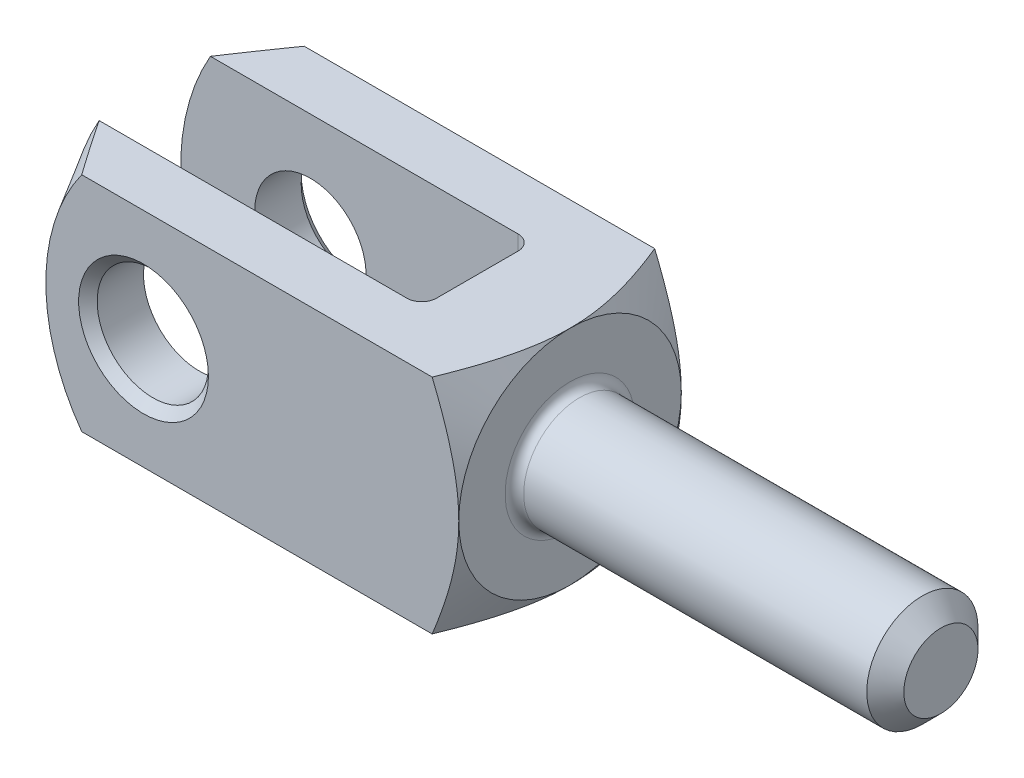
ISO-10303-21;
HEADER;
FILE_DESCRIPTION(('STEP AP214'),'2;1');
FILE_NAME('part.step','',(''),(''),'','','');
FILE_SCHEMA(('AUTOMOTIVE_DESIGN { 1 0 10303 214 1 1 1 1 }'));
ENDSEC;
DATA;
#1=APPLICATION_CONTEXT('core data for automotive mechanical design processes');
#2=APPLICATION_PROTOCOL_DEFINITION('international standard','automotive_design',2000,#1);
#3=PRODUCT_CONTEXT('',#1,'mechanical');
#4=PRODUCT('Part','Part','',(#3));
#5=PRODUCT_RELATED_PRODUCT_CATEGORY('part','',(#4));
#6=PRODUCT_DEFINITION_FORMATION('','',#4);
#7=PRODUCT_DEFINITION_CONTEXT('part definition',#1,'design');
#8=PRODUCT_DEFINITION('design','',#6,#7);
#9=PRODUCT_DEFINITION_SHAPE('','',#8);
#10=(LENGTH_UNIT() NAMED_UNIT(*) SI_UNIT(.MILLI.,.METRE.));
#11=(NAMED_UNIT(*) PLANE_ANGLE_UNIT() SI_UNIT($,.RADIAN.));
#12=(NAMED_UNIT(*) SI_UNIT($,.STERADIAN.) SOLID_ANGLE_UNIT());
#13=UNCERTAINTY_MEASURE_WITH_UNIT(LENGTH_MEASURE(1.E-05),#10,'distance_accuracy_value','');
#14=(GEOMETRIC_REPRESENTATION_CONTEXT(3) GLOBAL_UNCERTAINTY_ASSIGNED_CONTEXT((#13)) GLOBAL_UNIT_ASSIGNED_CONTEXT((#10,
#11,#12)) REPRESENTATION_CONTEXT('',''));
#15=CARTESIAN_POINT('',(0.,0.,0.));
#16=DIRECTION('',(0.,0.,1.));
#17=DIRECTION('',(1.,0.,0.));
#18=AXIS2_PLACEMENT_3D('',#15,#16,#17);
#19=CARTESIAN_POINT('',(-44.,-6.,-2.99999999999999));
#20=DIRECTION('',(0.,0.,-1.));
#21=DIRECTION('',(-1.,0.,0.));
#22=AXIS2_PLACEMENT_3D('',#19,#20,#21);
#23=PLANE('',#22);
#24=CARTESIAN_POINT('',(-37.,0.,-2.99999999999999));
#25=DIRECTION('',(0.,0.,-1.));
#26=DIRECTION('',(-1.,0.,0.));
#27=AXIS2_PLACEMENT_3D('',#24,#25,#26);
#28=CIRCLE('',#27,3.);
#29=CARTESIAN_POINT('',(-40.,0.,-2.99999999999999));
#30=VERTEX_POINT('',#29);
#31=EDGE_CURVE('E160',#30,#30,#28,.F.);
#32=ORIENTED_EDGE('',*,*,#31,.F.);
#33=EDGE_LOOP('',(#32));
#34=FACE_BOUND('',#33,.T.);
#35=DIRECTION('',(-1.,0.,0.));
#36=VECTOR('',#35,1.);
#37=CARTESIAN_POINT('',(-44.,6.,-2.99999999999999));
#38=LINE('',#37,#36);
#39=CARTESIAN_POINT('',(-25.8,6.,-2.99999999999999));
#40=VERTEX_POINT('',#39);
#41=CARTESIAN_POINT('',(-42.3923048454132,6.,-2.99999999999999));
#42=VERTEX_POINT('',#41);
#43=EDGE_CURVE('E322',#40,#42,#38,.T.);
#44=ORIENTED_EDGE('',*,*,#43,.T.);
#45=CARTESIAN_POINT('',(-32.,0.,-2.99999999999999));
#46=DIRECTION('',(0.,0.,1.));
#47=DIRECTION('',(1.,0.,0.));
#48=AXIS2_PLACEMENT_3D('',#45,#46,#47);
#49=CIRCLE('',#48,12.);
#50=CARTESIAN_POINT('',(-42.3923048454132,-6.,-2.99999999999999));
#51=VERTEX_POINT('',#50);
#52=EDGE_CURVE('E61',#42,#51,#49,.T.);
#53=ORIENTED_EDGE('',*,*,#52,.T.);
#54=DIRECTION('',(-1.,0.,0.));
#55=VECTOR('',#54,1.);
#56=CARTESIAN_POINT('',(-44.,-6.,-2.99999999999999));
#57=LINE('',#56,#55);
#58=CARTESIAN_POINT('',(-25.8,-6.,-2.99999999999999));
#59=VERTEX_POINT('',#58);
#60=EDGE_CURVE('E312',#59,#51,#57,.T.);
#61=ORIENTED_EDGE('',*,*,#60,.F.);
#62=DIRECTION('',(0.,1.,0.));
#63=VECTOR('',#62,1.);
#64=CARTESIAN_POINT('',(-25.8,6.,-2.99999999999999));
#65=LINE('',#64,#63);
#66=EDGE_CURVE('E183',#59,#40,#65,.T.);
#67=ORIENTED_EDGE('',*,*,#66,.T.);
#68=EDGE_LOOP('',(#44,#53,#61,#67));
#69=FACE_BOUND('',#68,.T.);
#70=ADVANCED_FACE('F37',(#34,#69),#23,.F.);
#71=CARTESIAN_POINT('',(-44.,-6.,3.));
#72=DIRECTION('',(0.,0.,1.));
#73=DIRECTION('',(1.,0.,0.));
#74=AXIS2_PLACEMENT_3D('',#71,#72,#73);
#75=PLANE('',#74);
#76=CARTESIAN_POINT('',(-37.,0.,3.));
#77=DIRECTION('',(0.,0.,1.));
#78=DIRECTION('',(1.,0.,0.));
#79=AXIS2_PLACEMENT_3D('',#76,#77,#78);
#80=CIRCLE('',#79,3.);
#81=CARTESIAN_POINT('',(-34.,0.,3.));
#82=VERTEX_POINT('',#81);
#83=EDGE_CURVE('E164',#82,#82,#80,.F.);
#84=ORIENTED_EDGE('',*,*,#83,.F.);
#85=EDGE_LOOP('',(#84));
#86=FACE_BOUND('',#85,.T.);
#87=CARTESIAN_POINT('',(-32.,0.,3.));
#88=DIRECTION('',(0.,0.,1.));
#89=DIRECTION('',(1.,0.,0.));
#90=AXIS2_PLACEMENT_3D('',#87,#88,#89);
#91=CIRCLE('',#90,12.);
#92=CARTESIAN_POINT('',(-42.3923048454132,6.,3.));
#93=VERTEX_POINT('',#92);
#94=CARTESIAN_POINT('',(-42.3923048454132,-6.,3.));
#95=VERTEX_POINT('',#94);
#96=EDGE_CURVE('E128',#93,#95,#91,.T.);
#97=ORIENTED_EDGE('',*,*,#96,.F.);
#98=DIRECTION('',(1.,0.,0.));
#99=VECTOR('',#98,1.);
#100=CARTESIAN_POINT('',(-44.,6.,3.));
#101=LINE('',#100,#99);
#102=CARTESIAN_POINT('',(-25.8,6.,2.99999999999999));
#103=VERTEX_POINT('',#102);
#104=EDGE_CURVE('E326',#93,#103,#101,.T.);
#105=ORIENTED_EDGE('',*,*,#104,.T.);
#106=DIRECTION('',(0.,1.,0.));
#107=VECTOR('',#106,1.);
#108=CARTESIAN_POINT('',(-25.8,-6.,2.99999999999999));
#109=LINE('',#108,#107);
#110=CARTESIAN_POINT('',(-25.8,-6.,2.99999999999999));
#111=VERTEX_POINT('',#110);
#112=EDGE_CURVE('E179',#103,#111,#109,.F.);
#113=ORIENTED_EDGE('',*,*,#112,.T.);
#114=DIRECTION('',(1.,0.,0.));
#115=VECTOR('',#114,1.);
#116=CARTESIAN_POINT('',(-44.,-6.,3.));
#117=LINE('',#116,#115);
#118=EDGE_CURVE('E315',#95,#111,#117,.T.);
#119=ORIENTED_EDGE('',*,*,#118,.F.);
#120=EDGE_LOOP('',(#97,#105,#113,#119));
#121=FACE_BOUND('',#120,.T.);
#122=ADVANCED_FACE('F386',(#86,#121),#75,.F.);
#123=CARTESIAN_POINT('',(-44.,-6.,6.));
#124=DIRECTION('',(0.,0.,1.));
#125=DIRECTION('',(1.,0.,0.));
#126=AXIS2_PLACEMENT_3D('',#123,#124,#125);
#127=PLANE('',#126);
#128=CARTESIAN_POINT('',(-37.,0.,6.));
#129=DIRECTION('',(0.,0.,1.));
#130=DIRECTION('',(1.,0.,0.));
#131=AXIS2_PLACEMENT_3D('',#128,#129,#130);
#132=CIRCLE('',#131,3.5);
#133=CARTESIAN_POINT('',(-33.5,0.,6.));
#134=VERTEX_POINT('',#133);
#135=EDGE_CURVE('E220',#134,#134,#132,.F.);
#136=ORIENTED_EDGE('',*,*,#135,.T.);
#137=EDGE_LOOP('',(#136));
#138=FACE_BOUND('',#137,.T.);
#139=DIRECTION('',(1.,0.,0.));
#140=VECTOR('',#139,1.);
#141=CARTESIAN_POINT('',(-44.,6.,6.));
#142=LINE('',#141,#140);
#143=CARTESIAN_POINT('',(-40.3325134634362,6.,6.));
#144=VERTEX_POINT('',#143);
#145=CARTESIAN_POINT('',(-21.4348778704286,6.,6.));
#146=VERTEX_POINT('',#145);
#147=EDGE_CURVE('E142',#144,#146,#142,.T.);
#148=ORIENTED_EDGE('',*,*,#147,.F.);
#149=CARTESIAN_POINT('',(-32.,0.,6.));
#150=DIRECTION('',(0.,0.,1.));
#151=DIRECTION('',(1.,0.,0.));
#152=AXIS2_PLACEMENT_3D('',#149,#150,#151);
#153=CIRCLE('',#152,10.2679491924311);
#154=CARTESIAN_POINT('',(-40.3325134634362,-6.,6.));
#155=VERTEX_POINT('',#154);
#156=EDGE_CURVE('E53',#144,#155,#153,.T.);
#157=ORIENTED_EDGE('',*,*,#156,.T.);
#158=DIRECTION('',(1.,0.,0.));
#159=VECTOR('',#158,1.);
#160=CARTESIAN_POINT('',(-44.,-6.,6.));
#161=LINE('',#160,#159);
#162=CARTESIAN_POINT('',(-21.4348778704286,-6.,6.));
#163=VERTEX_POINT('',#162);
#164=EDGE_CURVE('E139',#155,#163,#161,.T.);
#165=ORIENTED_EDGE('',*,*,#164,.T.);
#166=CARTESIAN_POINT('',(-24.4135240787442,-12.2544261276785,6.));
#167=CARTESIAN_POINT('',(-24.260207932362,-11.9587102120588,6.));
#168=CARTESIAN_POINT('',(-24.1077023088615,-11.6625701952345,6.));
#169=CARTESIAN_POINT('',(-23.8047419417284,-11.0692236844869,6.));
#170=CARTESIAN_POINT('',(-23.6542873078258,-10.7720171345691,6.));
#171=CARTESIAN_POINT('',(-23.3556153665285,-10.1758321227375,6.));
#172=CARTESIAN_POINT('',(-23.2074024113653,-9.87685147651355,6.));
#173=CARTESIAN_POINT('',(-22.9140958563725,-9.27736809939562,6.));
#174=CARTESIAN_POINT('',(-22.7690022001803,-8.97686539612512,6.));
#175=CARTESIAN_POINT('',(-22.4739226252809,-8.35545095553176,6.));
#176=CARTESIAN_POINT('',(-22.3241849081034,-8.03442101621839,6.));
#177=CARTESIAN_POINT('',(-22.0304086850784,-7.3897325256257,6.));
#178=CARTESIAN_POINT('',(-21.886370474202,-7.06607383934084,6.));
#179=CARTESIAN_POINT('',(-21.6058683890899,-6.41564861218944,6.));
#180=CARTESIAN_POINT('',(-21.4694011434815,-6.08888353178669,6.));
#181=CARTESIAN_POINT('',(-21.2064860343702,-5.43134466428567,6.));
#182=CARTESIAN_POINT('',(-21.0800369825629,-5.10057135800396,6.));
#183=CARTESIAN_POINT('',(-20.8875518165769,-4.56461982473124,6.));
#184=CARTESIAN_POINT('',(-20.8172472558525,-4.36097670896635,6.));
#185=CARTESIAN_POINT('',(-20.68269100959,-3.95170680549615,6.));
#186=CARTESIAN_POINT('',(-20.6184388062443,-3.74608018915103,6.));
#187=CARTESIAN_POINT('',(-20.4971759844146,-3.33269266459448,6.));
#188=CARTESIAN_POINT('',(-20.4401652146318,-3.12493180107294,6.));
#189=CARTESIAN_POINT('',(-20.3347478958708,-2.70722081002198,6.));
#190=CARTESIAN_POINT('',(-20.2863412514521,-2.49727070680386,6.));
#191=CARTESIAN_POINT('',(-20.2006095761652,-2.08023423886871,6.));
#192=CARTESIAN_POINT('',(-20.1630510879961,-1.87319634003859,6.));
#193=CARTESIAN_POINT('',(-20.098854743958,-1.4574199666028,6.));
#194=CARTESIAN_POINT('',(-20.0722165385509,-1.24868154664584,6.));
#195=CARTESIAN_POINT('',(-20.0309742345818,-0.830141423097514,6.));
#196=CARTESIAN_POINT('',(-20.0163622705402,-0.620340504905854,6.));
#197=CARTESIAN_POINT('',(-19.9998170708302,-0.200237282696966,6.));
#198=CARTESIAN_POINT('',(-19.9978833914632,0.0100650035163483,6.));
#199=CARTESIAN_POINT('',(-20.0064577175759,0.415074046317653,6.));
#200=CARTESIAN_POINT('',(-20.0160694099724,0.609800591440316,6.));
#201=CARTESIAN_POINT('',(-20.0458732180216,0.998433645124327,6.));
#202=CARTESIAN_POINT('',(-20.0660653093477,1.19234015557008,6.));
#203=CARTESIAN_POINT('',(-20.1162896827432,1.57896183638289,6.));
#204=CARTESIAN_POINT('',(-20.1463270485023,1.77167633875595,6.));
#205=CARTESIAN_POINT('',(-20.2152516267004,2.15550594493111,6.));
#206=CARTESIAN_POINT('',(-20.2541390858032,2.34662100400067,6.));
#207=CARTESIAN_POINT('',(-20.3409200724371,2.7325971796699,6.));
#208=CARTESIAN_POINT('',(-20.3890416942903,2.92740661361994,6.));
#209=CARTESIAN_POINT('',(-20.4923490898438,3.31513101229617,6.));
#210=CARTESIAN_POINT('',(-20.5475349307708,3.50804595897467,6.));
#211=CARTESIAN_POINT('',(-20.6639026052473,3.89203886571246,6.));
#212=CARTESIAN_POINT('',(-20.725084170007,4.08311690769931,6.));
#213=CARTESIAN_POINT('',(-20.8525079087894,4.46355855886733,6.));
#214=CARTESIAN_POINT('',(-20.9187498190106,4.65292225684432,6.));
#215=CARTESIAN_POINT('',(-21.0610705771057,5.04546937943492,6.));
#216=CARTESIAN_POINT('',(-21.1375111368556,5.24852125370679,6.));
#217=CARTESIAN_POINT('',(-21.2945475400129,5.65301574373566,6.));
#218=CARTESIAN_POINT('',(-21.3751435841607,5.8544582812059,6.));
#219=CARTESIAN_POINT('',(-21.6221320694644,6.45674423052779,6.));
#220=CARTESIAN_POINT('',(-21.7936954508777,6.85546660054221,6.));
#221=CARTESIAN_POINT('',(-22.146659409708,7.64890048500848,6.));
#222=CARTESIAN_POINT('',(-22.3280684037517,8.04360821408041,6.));
#223=CARTESIAN_POINT('',(-22.6979069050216,8.82965921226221,6.));
#224=CARTESIAN_POINT('',(-22.886335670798,9.22100283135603,6.));
#225=CARTESIAN_POINT('',(-23.2689881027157,10.0023172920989,6.));
#226=CARTESIAN_POINT('',(-23.463227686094,10.3922803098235,6.));
#227=CARTESIAN_POINT('',(-23.8556839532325,11.1702067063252,6.));
#228=CARTESIAN_POINT('',(-24.053900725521,11.5581700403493,6.));
#229=CARTESIAN_POINT('',(-24.4533033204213,12.3323174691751,6.));
#230=CARTESIAN_POINT('',(-24.6544876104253,12.7185023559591,6.));
#231=CARTESIAN_POINT('',(-25.0592727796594,13.4896043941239,6.));
#232=CARTESIAN_POINT('',(-25.2628736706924,13.8745215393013,6.));
#233=CARTESIAN_POINT('',(-25.8157959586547,14.9135601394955,6.));
#234=CARTESIAN_POINT('',(-26.1669414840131,15.5667104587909,6.));
#235=CARTESIAN_POINT('',(-26.8731950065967,16.8709801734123,6.));
#236=CARTESIAN_POINT('',(-27.2283035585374,17.522099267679,6.));
#237=CARTESIAN_POINT('',(-27.9393356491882,18.8190448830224,6.));
#238=CARTESIAN_POINT('',(-28.2952428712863,19.4648803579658,6.));
#239=CARTESIAN_POINT('',(-29.0091689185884,20.755250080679,6.));
#240=CARTESIAN_POINT('',(-29.3671874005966,21.3997845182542,6.));
#241=CARTESIAN_POINT('',(-29.7259616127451,22.0438949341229,6.));
#242=B_SPLINE_CURVE_WITH_KNOTS('',3,(#166,#167,#168,#169,#170,#171,#172,#173,#174,#175,#176,
#177,#178,#179,#180,#181,#182,#183,#184,#185,#186,#187,#188,#189,#190,#191,#192,#193,#194,#195,
#196,#197,#198,#199,#200,#201,#202,#203,#204,#205,#206,#207,#208,#209,#210,#211,#212,#213,#214,
#215,#216,#217,#218,#219,#220,#221,#222,#223,#224,#225,#226,#227,#228,#229,#230,#231,#232,#233,
#234,#235,#236,#237,#238,#239,#240,#241),.UNSPECIFIED.,.F.,.F.,(4,2,2,2,2,2,2,2,2,2,2,2,2,2,2,2,
2,2,2,2,2,2,2,2,2,2,2,2,2,2,2,2,2,2,2,2,2,4),(0.,0.999295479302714,1.99864421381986,
2.99973317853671,4.00080403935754,5.06346356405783,6.12617801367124,7.18841537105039,
8.25052654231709,8.89676374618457,9.54294561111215,10.1891139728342,10.8352751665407,
11.4662683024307,12.0972412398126,12.7278011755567,13.3583390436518,13.9429319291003,
14.5275234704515,15.1124173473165,15.6973275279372,16.2991674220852,16.9010130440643,
17.5028316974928,18.1046189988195,18.7554539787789,19.4063204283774,20.7083071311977,
22.0114249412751,23.3144055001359,24.6213589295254,25.9283414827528,27.2346711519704,
28.5410072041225,30.7656602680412,32.9906287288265,35.2028538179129,37.4147287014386),.UNSPECIFIED.);
#243=CARTESIAN_POINT('',(-20.,0.,6.));
#244=VERTEX_POINT('',#243);
#245=EDGE_CURVE('E284',#244,#163,#242,.F.);
#246=ORIENTED_EDGE('',*,*,#245,.F.);
#247=EDGE_CURVE('E282',#146,#244,#242,.F.);
#248=ORIENTED_EDGE('',*,*,#247,.F.);
#249=EDGE_LOOP('',(#148,#157,#165,#246,#248));
#250=FACE_BOUND('',#249,.T.);
#251=ADVANCED_FACE('F137',(#138,#250),#127,.T.);
#252=CARTESIAN_POINT('',(-44.,-6.,6.));
#253=DIRECTION('',(0.,-1.,0.));
#254=DIRECTION('',(0.,0.,-1.));
#255=AXIS2_PLACEMENT_3D('',#252,#253,#254);
#256=PLANE('',#255);
#257=ORIENTED_EDGE('',*,*,#60,.T.);
#258=CARTESIAN_POINT('',(-47.1393635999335,-6.,4.42179012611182));
#259=CARTESIAN_POINT('',(-46.8474254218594,-6.,3.9517431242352));
#260=CARTESIAN_POINT('',(-46.5546877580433,-6.,3.48219040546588));
#261=CARTESIAN_POINT('',(-45.9672392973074,-6.,2.5443080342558));
#262=CARTESIAN_POINT('',(-45.6725284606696,-6.,2.07597840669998));
#263=CARTESIAN_POINT('',(-45.0804179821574,-6.,1.14023742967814));
#264=CARTESIAN_POINT('',(-44.7830155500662,-6.,0.672827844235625));
#265=CARTESIAN_POINT('',(-44.1853697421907,-6.,-0.260167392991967));
#266=CARTESIAN_POINT('',(-43.8851263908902,-6.,-0.725753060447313));
#267=CARTESIAN_POINT('',(-43.2685694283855,-6.,-1.6739989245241));
#268=CARTESIAN_POINT('',(-42.9521073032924,-6.,-2.15656267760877));
#269=CARTESIAN_POINT('',(-42.3144057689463,-6.,-3.1185231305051));
#270=CARTESIAN_POINT('',(-41.9931664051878,-6.,-3.59791986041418));
#271=CARTESIAN_POINT('',(-41.3447668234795,-6.,-4.55217998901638));
#272=CARTESIAN_POINT('',(-41.017611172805,-6.,-5.02704648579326));
#273=CARTESIAN_POINT('',(-40.3552026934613,-6.,-5.97109163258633));
#274=CARTESIAN_POINT('',(-40.0199503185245,-6.,-6.44027059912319));
#275=CARTESIAN_POINT('',(-39.5103377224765,-6.,-7.135783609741));
#276=CARTESIAN_POINT('',(-39.3401620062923,-6.,-7.36518347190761));
#277=CARTESIAN_POINT('',(-38.9965727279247,-6.,-7.82154235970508));
#278=CARTESIAN_POINT('',(-38.8231592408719,-6.,-8.04850144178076));
#279=CARTESIAN_POINT('',(-38.4722215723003,-6.,-8.49973386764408));
#280=CARTESIAN_POINT('',(-38.2946919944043,-6.,-8.72400302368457));
#281=CARTESIAN_POINT('',(-37.9349539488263,-6.,-9.16874891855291));
#282=CARTESIAN_POINT('',(-37.7527457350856,-6.,-9.38922586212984));
#283=CARTESIAN_POINT('',(-37.3845109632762,-6.,-9.82306394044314));
#284=CARTESIAN_POINT('',(-37.1985436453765,-6.,-10.0364751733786));
#285=CARTESIAN_POINT('',(-36.8195986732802,-6.,-10.4571181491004));
#286=CARTESIAN_POINT('',(-36.6266192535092,-6.,-10.6643483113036));
#287=CARTESIAN_POINT('',(-36.2323728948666,-6.,-11.0699097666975));
#288=CARTESIAN_POINT('',(-36.031125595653,-6.,-11.2682600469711));
#289=CARTESIAN_POINT('',(-35.617711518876,-6.,-11.6531576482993));
#290=CARTESIAN_POINT('',(-35.4055521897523,-6.,-11.8397128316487));
#291=CARTESIAN_POINT('',(-35.0729884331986,-6.,-12.1098556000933));
#292=CARTESIAN_POINT('',(-34.9576788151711,-6.,-12.1997112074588));
#293=CARTESIAN_POINT('',(-34.7228111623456,-6.,-12.3737716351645));
#294=CARTESIAN_POINT('',(-34.6032522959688,-6.,-12.4579753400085));
#295=CARTESIAN_POINT('',(-34.3595319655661,-6.,-12.6192969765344));
#296=CARTESIAN_POINT('',(-34.2353742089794,-6.,-12.6964204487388));
#297=CARTESIAN_POINT('',(-33.9820787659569,-6.,-12.8418949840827));
#298=CARTESIAN_POINT('',(-33.8529423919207,-6.,-12.9102483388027));
#299=CARTESIAN_POINT('',(-33.5176686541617,-6.,-13.0703365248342));
#300=CARTESIAN_POINT('',(-33.3077768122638,-6.,-13.1546285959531));
#301=CARTESIAN_POINT('',(-32.9849826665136,-6.,-13.2547999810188));
#302=CARTESIAN_POINT('',(-32.8760885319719,-6.,-13.2838084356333));
#303=CARTESIAN_POINT('',(-32.6561770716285,-6.,-13.3320457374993));
#304=CARTESIAN_POINT('',(-32.5451609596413,-6.,-13.3512800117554));
#305=CARTESIAN_POINT('',(-32.3206486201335,-6.,-13.379300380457));
#306=CARTESIAN_POINT('',(-32.207138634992,-6.,-13.3879773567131));
#307=CARTESIAN_POINT('',(-31.9798158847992,-6.,-13.394110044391));
#308=CARTESIAN_POINT('',(-31.8660031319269,-6.,-13.3915662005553));
#309=CARTESIAN_POINT('',(-31.6391561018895,-6.,-13.3753792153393));
#310=CARTESIAN_POINT('',(-31.5261219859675,-6.,-13.361733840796));
#311=CARTESIAN_POINT('',(-31.3018245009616,-6.,-13.3239722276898));
#312=CARTESIAN_POINT('',(-31.190561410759,-6.,-13.2998543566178));
#313=CARTESIAN_POINT('',(-30.9501565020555,-6.,-13.2367814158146));
#314=CARTESIAN_POINT('',(-30.8215207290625,-6.,-13.1959054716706));
#315=CARTESIAN_POINT('',(-30.5684335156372,-6.,-13.1027470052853));
#316=CARTESIAN_POINT('',(-30.4439844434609,-6.,-13.050458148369));
#317=CARTESIAN_POINT('',(-30.1991880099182,-6.,-12.9362481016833));
#318=CARTESIAN_POINT('',(-30.0788537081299,-6.,-12.8742991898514));
#319=CARTESIAN_POINT('',(-29.8425871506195,-6.,-12.7426097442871));
#320=CARTESIAN_POINT('',(-29.7266544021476,-6.,-12.6728700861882));
#321=CARTESIAN_POINT('',(-29.4615159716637,-6.,-12.5031033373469));
#322=CARTESIAN_POINT('',(-29.3138719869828,-6.,-12.4006458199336));
#323=CARTESIAN_POINT('',(-29.024923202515,-6.,-12.1871088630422));
#324=CARTESIAN_POINT('',(-28.8836214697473,-6.,-12.076025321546));
#325=CARTESIAN_POINT('',(-28.6062884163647,-6.,-11.8469719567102));
#326=CARTESIAN_POINT('',(-28.4702677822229,-6.,-11.7289892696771));
#327=CARTESIAN_POINT('',(-28.203026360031,-6.,-11.4877793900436));
#328=CARTESIAN_POINT('',(-28.0718047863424,-6.,-11.3645530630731));
#329=CARTESIAN_POINT('',(-27.8125971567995,-6.,-11.1130582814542));
#330=CARTESIAN_POINT('',(-27.6846384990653,-6.,-10.9847616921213));
#331=CARTESIAN_POINT('',(-27.4322872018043,-6.,-10.7247007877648));
#332=CARTESIAN_POINT('',(-27.3078948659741,-6.,-10.5929361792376));
#333=CARTESIAN_POINT('',(-26.9395885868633,-6.,-10.1936988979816));
#334=CARTESIAN_POINT('',(-26.7002559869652,-6.,-9.92199665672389));
#335=CARTESIAN_POINT('',(-26.2996709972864,-6.,-9.45153467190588));
#336=CARTESIAN_POINT('',(-26.1360902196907,-6.,-9.25473181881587));
#337=CARTESIAN_POINT('',(-25.8127787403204,-6.,-8.85792160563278));
#338=CARTESIAN_POINT('',(-25.6530488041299,-6.,-8.65791362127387));
#339=CARTESIAN_POINT('',(-25.3392735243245,-6.,-8.25842615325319));
#340=CARTESIAN_POINT('',(-25.1851785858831,-6.,-8.0589854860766));
#341=CARTESIAN_POINT('',(-24.8797491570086,-6.,-7.65809556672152));
#342=CARTESIAN_POINT('',(-24.7284138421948,-6.,-7.45664694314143));
#343=CARTESIAN_POINT('',(-24.5782098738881,-6.,-7.25436752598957));
#344=B_SPLINE_CURVE_WITH_KNOTS('',3,(#258,#259,#260,#261,#262,#263,#264,#265,#266,#267,#268,
#269,#270,#271,#272,#273,#274,#275,#276,#277,#278,#279,#280,#281,#282,#283,#284,#285,#286,#287,
#288,#289,#290,#291,#292,#293,#294,#295,#296,#297,#298,#299,#300,#301,#302,#303,#304,#305,#306,
#307,#308,#309,#310,#311,#312,#313,#314,#315,#316,#317,#318,#319,#320,#321,#322,#323,#324,#325,
#326,#327,#328,#329,#330,#331,#332,#333,#334,#335,#336,#337,#338,#339,#340,#341,#342,#343),
.UNSPECIFIED.,.F.,.F.,(4,2,2,2,2,2,2,2,2,2,2,2,2,2,2,2,2,2,2,2,2,2,2,2,2,2,2,2,2,2,2,2,2,2,2,2,
2,2,2,2,2,2,4),(0.,1.65998663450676,3.32000678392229,4.98200894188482,6.64399678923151,
8.37520151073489,10.1063897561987,11.8362942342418,13.5661019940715,14.4229674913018,
15.2798131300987,16.1378539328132,16.9958482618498,17.8449395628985,18.6942461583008,
19.5416403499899,20.3884636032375,20.8268856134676,21.2653939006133,21.7035560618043,
22.1416034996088,22.8173812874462,23.1550908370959,23.4926126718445,23.8335942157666,
24.1745622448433,24.5155988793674,24.8566886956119,25.2609625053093,25.6654612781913,
26.0711429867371,26.4767791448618,27.0154896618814,27.5544579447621,28.0944653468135,
28.634383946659,29.1779015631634,29.7214653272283,30.8073733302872,31.5750640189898,
32.3429060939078,33.0989888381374,33.8548418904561),.UNSPECIFIED.);
#345=CARTESIAN_POINT('',(-40.3325134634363,-6.,-6.));
#346=VERTEX_POINT('',#345);
#347=EDGE_CURVE('E133',#51,#346,#344,.T.);
#348=ORIENTED_EDGE('',*,*,#347,.T.);
#349=DIRECTION('',(1.,0.,0.));
#350=VECTOR('',#349,1.);
#351=CARTESIAN_POINT('',(-44.,-6.,-6.));
#352=LINE('',#351,#350);
#353=CARTESIAN_POINT('',(-21.4348778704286,-6.,-6.));
#354=VERTEX_POINT('',#353);
#355=EDGE_CURVE('E152',#346,#354,#352,.T.);
#356=ORIENTED_EDGE('',*,*,#355,.T.);
#357=CARTESIAN_POINT('',(-24.4135240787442,-6.,-12.2544261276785));
#358=CARTESIAN_POINT('',(-24.260207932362,-6.,-11.9587102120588));
#359=CARTESIAN_POINT('',(-24.1077023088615,-6.,-11.6625701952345));
#360=CARTESIAN_POINT('',(-23.8047419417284,-6.,-11.0692236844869));
#361=CARTESIAN_POINT('',(-23.6542873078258,-6.,-10.7720171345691));
#362=CARTESIAN_POINT('',(-23.3556153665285,-6.,-10.1758321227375));
#363=CARTESIAN_POINT('',(-23.2074024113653,-6.,-9.87685147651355));
#364=CARTESIAN_POINT('',(-22.9140958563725,-6.,-9.27736809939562));
#365=CARTESIAN_POINT('',(-22.7690022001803,-6.,-8.97686539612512));
#366=CARTESIAN_POINT('',(-22.4739226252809,-6.,-8.35545095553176));
#367=CARTESIAN_POINT('',(-22.3241849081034,-6.,-8.03442101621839));
#368=CARTESIAN_POINT('',(-22.0304086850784,-6.,-7.3897325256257));
#369=CARTESIAN_POINT('',(-21.886370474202,-6.,-7.06607383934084));
#370=CARTESIAN_POINT('',(-21.6058683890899,-6.,-6.41564861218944));
#371=CARTESIAN_POINT('',(-21.4694011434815,-6.,-6.08888353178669));
#372=CARTESIAN_POINT('',(-21.2064860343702,-6.,-5.43134466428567));
#373=CARTESIAN_POINT('',(-21.0800369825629,-6.,-5.10057135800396));
#374=CARTESIAN_POINT('',(-20.8875518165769,-6.,-4.56461982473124));
#375=CARTESIAN_POINT('',(-20.8172472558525,-6.,-4.36097670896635));
#376=CARTESIAN_POINT('',(-20.68269100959,-6.,-3.95170680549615));
#377=CARTESIAN_POINT('',(-20.6184388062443,-6.,-3.74608018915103));
#378=CARTESIAN_POINT('',(-20.4971759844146,-6.,-3.33269266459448));
#379=CARTESIAN_POINT('',(-20.4401652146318,-6.,-3.12493180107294));
#380=CARTESIAN_POINT('',(-20.3347478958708,-6.,-2.70722081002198));
#381=CARTESIAN_POINT('',(-20.2863412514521,-6.,-2.49727070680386));
#382=CARTESIAN_POINT('',(-20.2006095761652,-6.,-2.08023423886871));
#383=CARTESIAN_POINT('',(-20.1630510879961,-6.,-1.87319634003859));
#384=CARTESIAN_POINT('',(-20.098854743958,-6.,-1.4574199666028));
#385=CARTESIAN_POINT('',(-20.0722165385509,-6.,-1.24868154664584));
#386=CARTESIAN_POINT('',(-20.0309742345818,-6.,-0.830141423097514));
#387=CARTESIAN_POINT('',(-20.0163622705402,-6.,-0.620340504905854));
#388=CARTESIAN_POINT('',(-19.9998170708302,-6.,-0.200237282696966));
#389=CARTESIAN_POINT('',(-19.9978833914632,-6.,0.0100650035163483));
#390=CARTESIAN_POINT('',(-20.0064577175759,-6.,0.415074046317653));
#391=CARTESIAN_POINT('',(-20.0160694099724,-6.,0.609800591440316));
#392=CARTESIAN_POINT('',(-20.0458732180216,-6.,0.998433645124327));
#393=CARTESIAN_POINT('',(-20.0660653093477,-6.,1.19234015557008));
#394=CARTESIAN_POINT('',(-20.1162896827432,-6.,1.57896183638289));
#395=CARTESIAN_POINT('',(-20.1463270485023,-6.,1.77167633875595));
#396=CARTESIAN_POINT('',(-20.2152516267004,-6.,2.15550594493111));
#397=CARTESIAN_POINT('',(-20.2541390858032,-6.,2.34662100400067));
#398=CARTESIAN_POINT('',(-20.3409200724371,-6.,2.7325971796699));
#399=CARTESIAN_POINT('',(-20.3890416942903,-6.,2.92740661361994));
#400=CARTESIAN_POINT('',(-20.4923490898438,-6.,3.31513101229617));
#401=CARTESIAN_POINT('',(-20.5475349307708,-6.,3.50804595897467));
#402=CARTESIAN_POINT('',(-20.6639026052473,-6.,3.89203886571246));
#403=CARTESIAN_POINT('',(-20.725084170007,-6.,4.08311690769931));
#404=CARTESIAN_POINT('',(-20.8525079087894,-6.,4.46355855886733));
#405=CARTESIAN_POINT('',(-20.9187498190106,-6.,4.65292225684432));
#406=CARTESIAN_POINT('',(-21.0610705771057,-6.,5.04546937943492));
#407=CARTESIAN_POINT('',(-21.1375111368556,-6.,5.24852125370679));
#408=CARTESIAN_POINT('',(-21.2945475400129,-6.,5.65301574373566));
#409=CARTESIAN_POINT('',(-21.3751435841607,-6.,5.8544582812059));
#410=CARTESIAN_POINT('',(-21.6221320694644,-6.,6.45674423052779));
#411=CARTESIAN_POINT('',(-21.7936954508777,-6.,6.85546660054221));
#412=CARTESIAN_POINT('',(-22.146659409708,-6.,7.64890048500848));
#413=CARTESIAN_POINT('',(-22.3280684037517,-6.,8.04360821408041));
#414=CARTESIAN_POINT('',(-22.6979069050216,-6.,8.82965921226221));
#415=CARTESIAN_POINT('',(-22.886335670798,-6.,9.22100283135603));
#416=CARTESIAN_POINT('',(-23.2689881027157,-6.,10.0023172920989));
#417=CARTESIAN_POINT('',(-23.463227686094,-6.,10.3922803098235));
#418=CARTESIAN_POINT('',(-23.8556839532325,-6.,11.1702067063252));
#419=CARTESIAN_POINT('',(-24.053900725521,-6.,11.5581700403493));
#420=CARTESIAN_POINT('',(-24.4533033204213,-6.,12.3323174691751));
#421=CARTESIAN_POINT('',(-24.6544876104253,-6.,12.7185023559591));
#422=CARTESIAN_POINT('',(-25.0592727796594,-6.,13.4896043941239));
#423=CARTESIAN_POINT('',(-25.2628736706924,-6.,13.8745215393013));
#424=CARTESIAN_POINT('',(-25.8157959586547,-6.,14.9135601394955));
#425=CARTESIAN_POINT('',(-26.1669414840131,-6.,15.5667104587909));
#426=CARTESIAN_POINT('',(-26.8731950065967,-6.,16.8709801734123));
#427=CARTESIAN_POINT('',(-27.2283035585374,-6.,17.522099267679));
#428=CARTESIAN_POINT('',(-27.9393356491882,-6.,18.8190448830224));
#429=CARTESIAN_POINT('',(-28.2952428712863,-6.,19.4648803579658));
#430=CARTESIAN_POINT('',(-29.0091689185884,-6.,20.755250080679));
#431=CARTESIAN_POINT('',(-29.3671874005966,-6.,21.3997845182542));
#432=CARTESIAN_POINT('',(-29.7259616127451,-6.,22.0438949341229));
#433=B_SPLINE_CURVE_WITH_KNOTS('',3,(#357,#358,#359,#360,#361,#362,#363,#364,#365,#366,#367,
#368,#369,#370,#371,#372,#373,#374,#375,#376,#377,#378,#379,#380,#381,#382,#383,#384,#385,#386,
#387,#388,#389,#390,#391,#392,#393,#394,#395,#396,#397,#398,#399,#400,#401,#402,#403,#404,#405,
#406,#407,#408,#409,#410,#411,#412,#413,#414,#415,#416,#417,#418,#419,#420,#421,#422,#423,#424,
#425,#426,#427,#428,#429,#430,#431,#432),.UNSPECIFIED.,.F.,.F.,(4,2,2,2,2,2,2,2,2,2,2,2,2,2,2,2,
2,2,2,2,2,2,2,2,2,2,2,2,2,2,2,2,2,2,2,2,2,4),(0.,0.999295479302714,1.99864421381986,
2.99973317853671,4.00080403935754,5.06346356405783,6.12617801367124,7.18841537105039,
8.25052654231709,8.89676374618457,9.54294561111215,10.1891139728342,10.8352751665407,
11.4662683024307,12.0972412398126,12.7278011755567,13.3583390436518,13.9429319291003,
14.5275234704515,15.1124173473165,15.6973275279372,16.2991674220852,16.9010130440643,
17.5028316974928,18.1046189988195,18.7554539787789,19.4063204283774,20.7083071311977,
22.0114249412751,23.3144055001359,24.6213589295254,25.9283414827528,27.2346711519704,
28.5410072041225,30.7656602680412,32.9906287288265,35.2028538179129,37.4147287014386),.UNSPECIFIED.);
#434=CARTESIAN_POINT('',(-20.,-6.,0.));
#435=VERTEX_POINT('',#434);
#436=EDGE_CURVE('E283',#435,#354,#433,.F.);
#437=ORIENTED_EDGE('',*,*,#436,.F.);
#438=EDGE_CURVE('E150',#163,#435,#433,.F.);
#439=ORIENTED_EDGE('',*,*,#438,.F.);
#440=ORIENTED_EDGE('',*,*,#164,.F.);
#441=CARTESIAN_POINT('',(-24.5782098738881,-6.,7.25436752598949));
#442=CARTESIAN_POINT('',(-24.700241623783,-6.,7.41872197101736));
#443=CARTESIAN_POINT('',(-24.8230275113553,-6.,7.58252077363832));
#444=CARTESIAN_POINT('',(-25.0703453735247,-6.,7.90881236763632));
#445=CARTESIAN_POINT('',(-25.1948774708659,-6.,8.07130506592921));
#446=CARTESIAN_POINT('',(-25.4461309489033,-6.,8.39505322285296));
#447=CARTESIAN_POINT('',(-25.572855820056,-6.,8.55630597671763));
#448=CARTESIAN_POINT('',(-25.8285625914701,-6.,8.87700833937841));
#449=CARTESIAN_POINT('',(-25.957544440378,-6.,9.03645798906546));
#450=CARTESIAN_POINT('',(-26.2193918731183,-6.,9.35478164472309));
#451=CARTESIAN_POINT('',(-26.3522831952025,-6.,9.51363451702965));
#452=CARTESIAN_POINT('',(-26.6211403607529,-6.,9.82871532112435));
#453=CARTESIAN_POINT('',(-26.7571061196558,-6.,9.98494332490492));
#454=CARTESIAN_POINT('',(-27.0325444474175,-6.,10.2941000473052));
#455=CARTESIAN_POINT('',(-27.1720146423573,-6.,10.4470308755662));
#456=CARTESIAN_POINT('',(-27.455170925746,-6.,10.7489264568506));
#457=CARTESIAN_POINT('',(-27.59885658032,-6.,10.8978916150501));
#458=CARTESIAN_POINT('',(-27.8681898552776,-6.,11.1677432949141));
#459=CARTESIAN_POINT('',(-27.9931100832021,-6.,11.2893541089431));
#460=CARTESIAN_POINT('',(-28.2470844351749,-6.,11.5282240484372));
#461=CARTESIAN_POINT('',(-28.3761389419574,-6.,11.645482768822));
#462=CARTESIAN_POINT('',(-28.6391009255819,-6.,11.8746072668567));
#463=CARTESIAN_POINT('',(-28.7730110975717,-6.,11.9864699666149));
#464=CARTESIAN_POINT('',(-29.0463546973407,-6.,12.2032558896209));
#465=CARTESIAN_POINT('',(-29.1857874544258,-6.,12.3081799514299));
#466=CARTESIAN_POINT('',(-29.4508780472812,-6.,12.4949451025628));
#467=CARTESIAN_POINT('',(-29.575707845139,-6.,12.5779553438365));
#468=CARTESIAN_POINT('',(-29.8305353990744,-6.,12.7357522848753));
#469=CARTESIAN_POINT('',(-29.9605339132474,-6.,12.8105377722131));
#470=CARTESIAN_POINT('',(-30.2255739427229,-6.,12.9495706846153));
#471=CARTESIAN_POINT('',(-30.3605981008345,-6.,13.0138508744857));
#472=CARTESIAN_POINT('',(-30.635993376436,-6.,13.1296505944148));
#473=CARTESIAN_POINT('',(-30.7763603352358,-6.,13.1811798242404));
#474=CARTESIAN_POINT('',(-31.0168612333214,-6.,13.2550378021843));
#475=CARTESIAN_POINT('',(-31.1157449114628,-6.,13.2814520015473));
#476=CARTESIAN_POINT('',(-31.3152765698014,-6.,13.3262531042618));
#477=CARTESIAN_POINT('',(-31.4159234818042,-6.,13.3446447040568));
#478=CARTESIAN_POINT('',(-31.6183885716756,-6.,13.3727723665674));
#479=CARTESIAN_POINT('',(-31.7202062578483,-6.,13.3825119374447));
#480=CARTESIAN_POINT('',(-31.9243091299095,-6.,13.3929798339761));
#481=CARTESIAN_POINT('',(-32.0265943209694,-6.,13.3937080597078));
#482=CARTESIAN_POINT('',(-32.2308773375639,-6.,13.3861179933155));
#483=CARTESIAN_POINT('',(-32.3328750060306,-6.,13.3777954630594));
#484=CARTESIAN_POINT('',(-32.5357523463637,-6.,13.3524330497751));
#485=CARTESIAN_POINT('',(-32.6366320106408,-6.,13.3353931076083));
#486=CARTESIAN_POINT('',(-32.9367339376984,-6.,13.2720213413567));
#487=CARTESIAN_POINT('',(-33.1334496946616,-6.,13.2134361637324));
#488=CARTESIAN_POINT('',(-33.4751542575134,-6.,13.0858566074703));
#489=CARTESIAN_POINT('',(-33.6221121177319,-6.,13.0218717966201));
#490=CARTESIAN_POINT('',(-33.9098697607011,-6.,12.8811368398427));
#491=CARTESIAN_POINT('',(-34.0506652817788,-6.,12.8043780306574));
#492=CARTESIAN_POINT('',(-34.3268069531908,-6.,12.6404930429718));
#493=CARTESIAN_POINT('',(-34.4621280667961,-6.,12.5533251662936));
#494=CARTESIAN_POINT('',(-34.6609403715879,-6.,12.4166394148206));
#495=CARTESIAN_POINT('',(-34.7265069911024,-6.,12.3700957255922));
#496=CARTESIAN_POINT('',(-34.8563442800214,-6.,12.2752346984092));
#497=CARTESIAN_POINT('',(-34.920614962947,-6.,12.2269173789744));
#498=CARTESIAN_POINT('',(-35.113089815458,-6.,12.078456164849));
#499=CARTESIAN_POINT('',(-35.2394167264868,-6.,11.9758731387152));
#500=CARTESIAN_POINT('',(-35.4877284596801,-6.,11.765558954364));
#501=CARTESIAN_POINT('',(-35.6097121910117,-6.,11.6578265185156));
#502=CARTESIAN_POINT('',(-35.8499782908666,-6.,11.4381228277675));
#503=CARTESIAN_POINT('',(-35.9682574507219,-6.,11.3261480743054));
#504=CARTESIAN_POINT('',(-36.2015010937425,-6.,11.0987903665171));
#505=CARTESIAN_POINT('',(-36.3164652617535,-6.,10.9834070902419));
#506=CARTESIAN_POINT('',(-36.6578107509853,-6.,10.6322551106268));
#507=CARTESIAN_POINT('',(-36.8798295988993,-6.,10.3922441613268));
#508=CARTESIAN_POINT('',(-37.3148087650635,-6.,9.90442576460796));
#509=CARTESIAN_POINT('',(-37.5277730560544,-6.,9.65662182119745));
#510=CARTESIAN_POINT('',(-37.9492849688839,-6.,9.15205909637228));
#511=CARTESIAN_POINT('',(-38.1577449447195,-6.,8.89522733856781));
#512=CARTESIAN_POINT('',(-38.5689584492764,-6.,8.3770130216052));
#513=CARTESIAN_POINT('',(-38.7717114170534,-6.,8.11563001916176));
#514=CARTESIAN_POINT('',(-39.1721475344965,-6.,7.58991714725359));
#515=CARTESIAN_POINT('',(-39.3698407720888,-6.,7.32559494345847));
#516=CARTESIAN_POINT('',(-39.7614393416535,-6.,6.79415637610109));
#517=CARTESIAN_POINT('',(-39.9553445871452,-6.,6.52703994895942));
#518=CARTESIAN_POINT('',(-40.4640544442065,-6.,5.81756468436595));
#519=CARTESIAN_POINT('',(-40.7761810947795,-6.,5.37328669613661));
#520=CARTESIAN_POINT('',(-41.3940279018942,-6.,4.4802928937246));
#521=CARTESIAN_POINT('',(-41.6997478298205,-6.,4.03157692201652));
#522=CARTESIAN_POINT('',(-42.3064727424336,-6.,3.13038339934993));
#523=CARTESIAN_POINT('',(-42.6074732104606,-6.,2.67790281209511));
#524=CARTESIAN_POINT('',(-43.2055142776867,-6.,1.77033247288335));
#525=CARTESIAN_POINT('',(-43.5025548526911,-6.,1.31524270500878));
#526=CARTESIAN_POINT('',(-44.0812837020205,-6.,0.421758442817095));
#527=CARTESIAN_POINT('',(-44.3631008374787,-6.,-0.0165526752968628));
#528=CARTESIAN_POINT('',(-44.9243069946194,-6.,-0.894729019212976));
#529=CARTESIAN_POINT('',(-45.2036960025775,-6.,-1.33459425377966));
#530=CARTESIAN_POINT('',(-45.7601107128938,-6.,-2.21507346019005));
#531=CARTESIAN_POINT('',(-46.0371388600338,-6.,-2.65568588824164));
#532=CARTESIAN_POINT('',(-46.5894693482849,-6.,-3.53798241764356));
#533=CARTESIAN_POINT('',(-46.8647717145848,-6.,-3.97966650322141));
#534=CARTESIAN_POINT('',(-47.1393635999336,-6.,-4.42179012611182));
#535=B_SPLINE_CURVE_WITH_KNOTS('',3,(#441,#442,#443,#444,#445,#446,#447,#448,#449,#450,#451,
#452,#453,#454,#455,#456,#457,#458,#459,#460,#461,#462,#463,#464,#465,#466,#467,#468,#469,#470,
#471,#472,#473,#474,#475,#476,#477,#478,#479,#480,#481,#482,#483,#484,#485,#486,#487,#488,#489,
#490,#491,#492,#493,#494,#495,#496,#497,#498,#499,#500,#501,#502,#503,#504,#505,#506,#507,#508,
#509,#510,#511,#512,#513,#514,#515,#516,#517,#518,#519,#520,#521,#522,#523,#524,#525,#526,#527,
#528,#529,#530,#531,#532,#533,#534),.UNSPECIFIED.,.F.,.F.,(4,2,2,2,2,2,2,2,2,2,2,2,2,2,2,2,2,2,
2,2,2,2,2,2,2,2,2,2,2,2,2,2,2,2,2,2,2,2,2,2,2,2,2,2,2,2,4),(0.,0.614117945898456,
1.22827927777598,1.84352963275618,2.45876600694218,3.0800613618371,3.70133964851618,
4.32220785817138,4.94301238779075,5.46594722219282,5.98893060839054,6.51220885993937,
7.03542375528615,7.48490142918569,7.93444527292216,8.38255911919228,8.83033102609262,
9.13709426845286,9.443677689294,9.75013674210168,10.056599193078,10.3632052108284,
10.6698133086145,11.2829388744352,11.7631521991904,12.2436925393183,12.7262269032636,
12.9674237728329,13.2086181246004,13.6966259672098,14.184755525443,14.6732967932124,
15.1618843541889,16.1423992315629,17.1224793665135,18.1147260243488,19.1070698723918,
20.0972505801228,21.0874538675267,22.716251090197,24.3451063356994,25.9754354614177,
27.6057745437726,29.1690430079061,30.732320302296,32.2937113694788,33.8550795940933),.UNSPECIFIED.);
#536=EDGE_CURVE('E125',#155,#95,#535,.T.);
#537=ORIENTED_EDGE('',*,*,#536,.T.);
#538=ORIENTED_EDGE('',*,*,#118,.T.);
#539=CARTESIAN_POINT('',(-25.8,-6.,2.19999999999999));
#540=DIRECTION('',(0.,-1.,0.));
#541=DIRECTION('',(0.,0.,-1.));
#542=AXIS2_PLACEMENT_3D('',#539,#540,#541);
#543=CIRCLE('',#542,0.8);
#544=CARTESIAN_POINT('',(-25.,-6.,2.19999999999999));
#545=VERTEX_POINT('',#544);
#546=EDGE_CURVE('E191',#111,#545,#543,.F.);
#547=ORIENTED_EDGE('',*,*,#546,.T.);
#548=DIRECTION('',(0.,0.,-1.));
#549=VECTOR('',#548,1.);
#550=CARTESIAN_POINT('',(-25.,-6.,-2.99999999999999));
#551=LINE('',#550,#549);
#552=CARTESIAN_POINT('',(-25.,-6.,-2.19999999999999));
#553=VERTEX_POINT('',#552);
#554=EDGE_CURVE('E168',#545,#553,#551,.T.);
#555=ORIENTED_EDGE('',*,*,#554,.T.);
#556=CARTESIAN_POINT('',(-25.8,-6.,-2.19999999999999));
#557=DIRECTION('',(0.,-1.,0.));
#558=DIRECTION('',(0.,0.,-1.));
#559=AXIS2_PLACEMENT_3D('',#556,#557,#558);
#560=CIRCLE('',#559,0.8);
#561=EDGE_CURVE('E197',#553,#59,#560,.F.);
#562=ORIENTED_EDGE('',*,*,#561,.T.);
#563=EDGE_LOOP('',(#257,#348,#356,#437,#439,#440,#537,#538,#547,#555,#562));
#564=FACE_BOUND('',#563,.T.);
#565=ADVANCED_FACE('F148',(#564),#256,.T.);
#566=CARTESIAN_POINT('',(-44.,-6.,-6.));
#567=DIRECTION('',(0.,0.,-1.));
#568=DIRECTION('',(-1.,0.,0.));
#569=AXIS2_PLACEMENT_3D('',#566,#567,#568);
#570=PLANE('',#569);
#571=CARTESIAN_POINT('',(-37.,0.,-6.));
#572=DIRECTION('',(0.,0.,-1.));
#573=DIRECTION('',(-1.,0.,0.));
#574=AXIS2_PLACEMENT_3D('',#571,#572,#573);
#575=CIRCLE('',#574,3.5);
#576=CARTESIAN_POINT('',(-40.5,0.,-6.));
#577=VERTEX_POINT('',#576);
#578=EDGE_CURVE('E208',#577,#577,#575,.F.);
#579=ORIENTED_EDGE('',*,*,#578,.T.);
#580=EDGE_LOOP('',(#579));
#581=FACE_BOUND('',#580,.T.);
#582=ORIENTED_EDGE('',*,*,#355,.F.);
#583=CARTESIAN_POINT('',(-32.,0.,-6.));
#584=DIRECTION('',(0.,0.,1.));
#585=DIRECTION('',(1.,0.,0.));
#586=AXIS2_PLACEMENT_3D('',#583,#584,#585);
#587=CIRCLE('',#586,10.2679491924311);
#588=CARTESIAN_POINT('',(-40.3325134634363,6.,-6.));
#589=VERTEX_POINT('',#588);
#590=EDGE_CURVE('E144',#589,#346,#587,.T.);
#591=ORIENTED_EDGE('',*,*,#590,.F.);
#592=DIRECTION('',(1.,0.,0.));
#593=VECTOR('',#592,1.);
#594=CARTESIAN_POINT('',(-44.,6.,-6.));
#595=LINE('',#594,#593);
#596=CARTESIAN_POINT('',(-21.4348778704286,6.,-6.));
#597=VERTEX_POINT('',#596);
#598=EDGE_CURVE('E157',#589,#597,#595,.T.);
#599=ORIENTED_EDGE('',*,*,#598,.T.);
#600=CARTESIAN_POINT('',(-24.4135240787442,-12.2544261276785,-6.));
#601=CARTESIAN_POINT('',(-24.260207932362,-11.9587102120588,-6.));
#602=CARTESIAN_POINT('',(-24.1077023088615,-11.6625701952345,-6.));
#603=CARTESIAN_POINT('',(-23.8047419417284,-11.0692236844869,-6.));
#604=CARTESIAN_POINT('',(-23.6542873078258,-10.7720171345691,-6.));
#605=CARTESIAN_POINT('',(-23.3556153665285,-10.1758321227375,-6.));
#606=CARTESIAN_POINT('',(-23.2074024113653,-9.87685147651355,-6.));
#607=CARTESIAN_POINT('',(-22.9140958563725,-9.27736809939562,-6.));
#608=CARTESIAN_POINT('',(-22.7690022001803,-8.97686539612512,-6.));
#609=CARTESIAN_POINT('',(-22.4739226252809,-8.35545095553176,-6.));
#610=CARTESIAN_POINT('',(-22.3241849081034,-8.03442101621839,-6.));
#611=CARTESIAN_POINT('',(-22.0304086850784,-7.3897325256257,-6.));
#612=CARTESIAN_POINT('',(-21.886370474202,-7.06607383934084,-6.));
#613=CARTESIAN_POINT('',(-21.6058683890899,-6.41564861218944,-6.));
#614=CARTESIAN_POINT('',(-21.4694011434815,-6.08888353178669,-6.));
#615=CARTESIAN_POINT('',(-21.2064860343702,-5.43134466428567,-6.));
#616=CARTESIAN_POINT('',(-21.0800369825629,-5.10057135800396,-6.));
#617=CARTESIAN_POINT('',(-20.8875518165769,-4.56461982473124,-6.));
#618=CARTESIAN_POINT('',(-20.8172472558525,-4.36097670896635,-6.));
#619=CARTESIAN_POINT('',(-20.68269100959,-3.95170680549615,-6.));
#620=CARTESIAN_POINT('',(-20.6184388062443,-3.74608018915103,-6.));
#621=CARTESIAN_POINT('',(-20.4971759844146,-3.33269266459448,-6.));
#622=CARTESIAN_POINT('',(-20.4401652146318,-3.12493180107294,-6.));
#623=CARTESIAN_POINT('',(-20.3347478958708,-2.70722081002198,-6.));
#624=CARTESIAN_POINT('',(-20.2863412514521,-2.49727070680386,-6.));
#625=CARTESIAN_POINT('',(-20.2006095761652,-2.08023423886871,-6.));
#626=CARTESIAN_POINT('',(-20.1630510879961,-1.87319634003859,-6.));
#627=CARTESIAN_POINT('',(-20.098854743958,-1.4574199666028,-6.));
#628=CARTESIAN_POINT('',(-20.0722165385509,-1.24868154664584,-6.));
#629=CARTESIAN_POINT('',(-20.0309742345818,-0.830141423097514,-6.));
#630=CARTESIAN_POINT('',(-20.0163622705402,-0.620340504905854,-6.));
#631=CARTESIAN_POINT('',(-19.9998170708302,-0.200237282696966,-6.));
#632=CARTESIAN_POINT('',(-19.9978833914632,0.0100650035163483,-6.));
#633=CARTESIAN_POINT('',(-20.0064577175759,0.415074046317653,-6.));
#634=CARTESIAN_POINT('',(-20.0160694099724,0.609800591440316,-6.));
#635=CARTESIAN_POINT('',(-20.0458732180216,0.998433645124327,-6.));
#636=CARTESIAN_POINT('',(-20.0660653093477,1.19234015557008,-6.));
#637=CARTESIAN_POINT('',(-20.1162896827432,1.57896183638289,-6.));
#638=CARTESIAN_POINT('',(-20.1463270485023,1.77167633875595,-6.));
#639=CARTESIAN_POINT('',(-20.2152516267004,2.15550594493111,-6.));
#640=CARTESIAN_POINT('',(-20.2541390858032,2.34662100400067,-6.));
#641=CARTESIAN_POINT('',(-20.3409200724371,2.7325971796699,-6.));
#642=CARTESIAN_POINT('',(-20.3890416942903,2.92740661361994,-6.));
#643=CARTESIAN_POINT('',(-20.4923490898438,3.31513101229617,-6.));
#644=CARTESIAN_POINT('',(-20.5475349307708,3.50804595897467,-6.));
#645=CARTESIAN_POINT('',(-20.6639026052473,3.89203886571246,-6.));
#646=CARTESIAN_POINT('',(-20.725084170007,4.08311690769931,-6.));
#647=CARTESIAN_POINT('',(-20.8525079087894,4.46355855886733,-6.));
#648=CARTESIAN_POINT('',(-20.9187498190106,4.65292225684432,-6.));
#649=CARTESIAN_POINT('',(-21.0610705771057,5.04546937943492,-6.));
#650=CARTESIAN_POINT('',(-21.1375111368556,5.24852125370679,-6.));
#651=CARTESIAN_POINT('',(-21.2945475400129,5.65301574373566,-6.));
#652=CARTESIAN_POINT('',(-21.3751435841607,5.8544582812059,-6.));
#653=CARTESIAN_POINT('',(-21.6221320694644,6.45674423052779,-6.));
#654=CARTESIAN_POINT('',(-21.7936954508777,6.85546660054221,-6.));
#655=CARTESIAN_POINT('',(-22.146659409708,7.64890048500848,-6.));
#656=CARTESIAN_POINT('',(-22.3280684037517,8.04360821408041,-6.));
#657=CARTESIAN_POINT('',(-22.6979069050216,8.82965921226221,-6.));
#658=CARTESIAN_POINT('',(-22.886335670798,9.22100283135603,-6.));
#659=CARTESIAN_POINT('',(-23.2689881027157,10.0023172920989,-6.));
#660=CARTESIAN_POINT('',(-23.463227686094,10.3922803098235,-6.));
#661=CARTESIAN_POINT('',(-23.8556839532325,11.1702067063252,-6.));
#662=CARTESIAN_POINT('',(-24.053900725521,11.5581700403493,-6.));
#663=CARTESIAN_POINT('',(-24.4533033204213,12.3323174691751,-6.));
#664=CARTESIAN_POINT('',(-24.6544876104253,12.7185023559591,-6.));
#665=CARTESIAN_POINT('',(-25.0592727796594,13.4896043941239,-6.));
#666=CARTESIAN_POINT('',(-25.2628736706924,13.8745215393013,-6.));
#667=CARTESIAN_POINT('',(-25.8157959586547,14.9135601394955,-6.));
#668=CARTESIAN_POINT('',(-26.1669414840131,15.5667104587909,-6.));
#669=CARTESIAN_POINT('',(-26.8731950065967,16.8709801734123,-6.));
#670=CARTESIAN_POINT('',(-27.2283035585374,17.522099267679,-6.));
#671=CARTESIAN_POINT('',(-27.9393356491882,18.8190448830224,-6.));
#672=CARTESIAN_POINT('',(-28.2952428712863,19.4648803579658,-6.));
#673=CARTESIAN_POINT('',(-29.0091689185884,20.755250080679,-6.));
#674=CARTESIAN_POINT('',(-29.3671874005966,21.3997845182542,-6.));
#675=CARTESIAN_POINT('',(-29.7259616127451,22.0438949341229,-6.));
#676=B_SPLINE_CURVE_WITH_KNOTS('',3,(#600,#601,#602,#603,#604,#605,#606,#607,#608,#609,#610,
#611,#612,#613,#614,#615,#616,#617,#618,#619,#620,#621,#622,#623,#624,#625,#626,#627,#628,#629,
#630,#631,#632,#633,#634,#635,#636,#637,#638,#639,#640,#641,#642,#643,#644,#645,#646,#647,#648,
#649,#650,#651,#652,#653,#654,#655,#656,#657,#658,#659,#660,#661,#662,#663,#664,#665,#666,#667,
#668,#669,#670,#671,#672,#673,#674,#675),.UNSPECIFIED.,.F.,.F.,(4,2,2,2,2,2,2,2,2,2,2,2,2,2,2,2,
2,2,2,2,2,2,2,2,2,2,2,2,2,2,2,2,2,2,2,2,2,4),(0.,0.999295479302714,1.99864421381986,
2.99973317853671,4.00080403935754,5.06346356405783,6.12617801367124,7.18841537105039,
8.25052654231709,8.89676374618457,9.54294561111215,10.1891139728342,10.8352751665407,
11.4662683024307,12.0972412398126,12.7278011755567,13.3583390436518,13.9429319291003,
14.5275234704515,15.1124173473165,15.6973275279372,16.2991674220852,16.9010130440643,
17.5028316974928,18.1046189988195,18.7554539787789,19.4063204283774,20.7083071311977,
22.0114249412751,23.3144055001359,24.6213589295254,25.9283414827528,27.2346711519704,
28.5410072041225,30.7656602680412,32.9906287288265,35.2028538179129,37.4147287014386),.UNSPECIFIED.);
#677=CARTESIAN_POINT('',(-20.,0.,-6.));
#678=VERTEX_POINT('',#677);
#679=EDGE_CURVE('E304',#678,#597,#676,.T.);
#680=ORIENTED_EDGE('',*,*,#679,.F.);
#681=EDGE_CURVE('E311',#354,#678,#676,.T.);
#682=ORIENTED_EDGE('',*,*,#681,.F.);
#683=EDGE_LOOP('',(#582,#591,#599,#680,#682));
#684=FACE_BOUND('',#683,.T.);
#685=ADVANCED_FACE('F268',(#581,#684),#570,.T.);
#686=CARTESIAN_POINT('',(-44.,6.,6.));
#687=DIRECTION('',(0.,1.,0.));
#688=DIRECTION('',(0.,0.,1.));
#689=AXIS2_PLACEMENT_3D('',#686,#687,#688);
#690=PLANE('',#689);
#691=ORIENTED_EDGE('',*,*,#598,.F.);
#692=CARTESIAN_POINT('',(-24.5782098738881,6.,-7.25436752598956));
#693=CARTESIAN_POINT('',(-24.700241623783,6.,-7.41872197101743));
#694=CARTESIAN_POINT('',(-24.8230275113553,6.,-7.58252077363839));
#695=CARTESIAN_POINT('',(-25.0703453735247,6.,-7.90881236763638));
#696=CARTESIAN_POINT('',(-25.1948774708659,6.,-8.07130506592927));
#697=CARTESIAN_POINT('',(-25.4461309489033,6.,-8.39505322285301));
#698=CARTESIAN_POINT('',(-25.572855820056,6.,-8.55630597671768));
#699=CARTESIAN_POINT('',(-25.8285625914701,6.,-8.87700833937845));
#700=CARTESIAN_POINT('',(-25.9575444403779,6.,-9.0364579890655));
#701=CARTESIAN_POINT('',(-26.2193918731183,6.,-9.35478164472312));
#702=CARTESIAN_POINT('',(-26.3522831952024,6.,-9.51363451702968));
#703=CARTESIAN_POINT('',(-26.6211403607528,6.,-9.82871532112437));
#704=CARTESIAN_POINT('',(-26.7571061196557,6.,-9.98494332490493));
#705=CARTESIAN_POINT('',(-27.0325444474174,6.,-10.2941000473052));
#706=CARTESIAN_POINT('',(-27.1720146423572,6.,-10.4470308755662));
#707=CARTESIAN_POINT('',(-27.4551709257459,6.,-10.7489264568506));
#708=CARTESIAN_POINT('',(-27.5988565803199,6.,-10.8978916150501));
#709=CARTESIAN_POINT('',(-27.8681898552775,6.,-11.1677432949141));
#710=CARTESIAN_POINT('',(-27.9931100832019,6.,-11.2893541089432));
#711=CARTESIAN_POINT('',(-28.2470844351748,6.,-11.5282240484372));
#712=CARTESIAN_POINT('',(-28.3761389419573,6.,-11.6454827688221));
#713=CARTESIAN_POINT('',(-28.6391009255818,6.,-11.8746072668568));
#714=CARTESIAN_POINT('',(-28.7730110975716,6.,-11.986469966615));
#715=CARTESIAN_POINT('',(-29.0463546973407,6.,-12.2032558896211));
#716=CARTESIAN_POINT('',(-29.1857874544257,6.,-12.30817995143));
#717=CARTESIAN_POINT('',(-29.4508780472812,6.,-12.494945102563));
#718=CARTESIAN_POINT('',(-29.5757078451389,6.,-12.5779553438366));
#719=CARTESIAN_POINT('',(-29.8305353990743,6.,-12.7357522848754));
#720=CARTESIAN_POINT('',(-29.9605339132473,6.,-12.8105377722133));
#721=CARTESIAN_POINT('',(-30.2255739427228,6.,-12.9495706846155));
#722=CARTESIAN_POINT('',(-30.3605981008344,6.,-13.0138508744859));
#723=CARTESIAN_POINT('',(-30.6359933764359,6.,-13.1296505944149));
#724=CARTESIAN_POINT('',(-30.7763603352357,6.,-13.1811798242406));
#725=CARTESIAN_POINT('',(-31.0168612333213,6.,-13.2550378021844));
#726=CARTESIAN_POINT('',(-31.1157449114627,6.,-13.2814520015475));
#727=CARTESIAN_POINT('',(-31.3152765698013,6.,-13.326253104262));
#728=CARTESIAN_POINT('',(-31.4159234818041,6.,-13.344644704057));
#729=CARTESIAN_POINT('',(-31.6183885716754,6.,-13.3727723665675));
#730=CARTESIAN_POINT('',(-31.7202062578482,6.,-13.3825119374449));
#731=CARTESIAN_POINT('',(-31.9243091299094,6.,-13.3929798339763));
#732=CARTESIAN_POINT('',(-32.0265943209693,6.,-13.393708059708));
#733=CARTESIAN_POINT('',(-32.2308773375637,6.,-13.3861179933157));
#734=CARTESIAN_POINT('',(-32.3328750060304,6.,-13.3777954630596));
#735=CARTESIAN_POINT('',(-32.5357523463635,6.,-13.3524330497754));
#736=CARTESIAN_POINT('',(-32.6366320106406,6.,-13.3353931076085));
#737=CARTESIAN_POINT('',(-32.9367339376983,6.,-13.2720213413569));
#738=CARTESIAN_POINT('',(-33.1334496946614,6.,-13.2134361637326));
#739=CARTESIAN_POINT('',(-33.4751542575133,6.,-13.0858566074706));
#740=CARTESIAN_POINT('',(-33.6221121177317,6.,-13.0218717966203));
#741=CARTESIAN_POINT('',(-33.9098697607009,6.,-12.8811368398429));
#742=CARTESIAN_POINT('',(-34.0506652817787,6.,-12.8043780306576));
#743=CARTESIAN_POINT('',(-34.3268069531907,6.,-12.6404930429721));
#744=CARTESIAN_POINT('',(-34.4621280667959,6.,-12.5533251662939));
#745=CARTESIAN_POINT('',(-34.6609403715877,6.,-12.4166394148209));
#746=CARTESIAN_POINT('',(-34.7265069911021,6.,-12.3700957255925));
#747=CARTESIAN_POINT('',(-34.8563442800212,6.,-12.2752346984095));
#748=CARTESIAN_POINT('',(-34.9206149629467,6.,-12.2269173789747));
#749=CARTESIAN_POINT('',(-35.1130898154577,6.,-12.0784561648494));
#750=CARTESIAN_POINT('',(-35.2394167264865,6.,-11.9758731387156));
#751=CARTESIAN_POINT('',(-35.4877284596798,6.,-11.7655589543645));
#752=CARTESIAN_POINT('',(-35.6097121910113,6.,-11.6578265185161));
#753=CARTESIAN_POINT('',(-35.8499782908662,6.,-11.438122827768));
#754=CARTESIAN_POINT('',(-35.9682574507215,6.,-11.3261480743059));
#755=CARTESIAN_POINT('',(-36.2015010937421,6.,-11.0987903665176));
#756=CARTESIAN_POINT('',(-36.316465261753,6.,-10.9834070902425));
#757=CARTESIAN_POINT('',(-36.6578107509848,6.,-10.6322551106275));
#758=CARTESIAN_POINT('',(-36.8798295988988,6.,-10.3922441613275));
#759=CARTESIAN_POINT('',(-37.3148087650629,6.,-9.90442576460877));
#760=CARTESIAN_POINT('',(-37.5277730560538,6.,-9.65662182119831));
#761=CARTESIAN_POINT('',(-37.9492849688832,6.,-9.15205909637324));
#762=CARTESIAN_POINT('',(-38.1577449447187,6.,-8.89522733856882));
#763=CARTESIAN_POINT('',(-38.5689584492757,6.,-8.37701302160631));
#764=CARTESIAN_POINT('',(-38.7717114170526,6.,-8.11563001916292));
#765=CARTESIAN_POINT('',(-39.1721475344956,6.,-7.58991714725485));
#766=CARTESIAN_POINT('',(-39.3698407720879,6.,-7.32559494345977));
#767=CARTESIAN_POINT('',(-39.7614393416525,6.,-6.79415637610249));
#768=CARTESIAN_POINT('',(-39.9553445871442,6.,-6.52703994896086));
#769=CARTESIAN_POINT('',(-40.4640544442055,6.,-5.81756468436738));
#770=CARTESIAN_POINT('',(-40.7761810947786,6.,-5.37328669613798));
#771=CARTESIAN_POINT('',(-41.3940279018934,6.,-4.48029289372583));
#772=CARTESIAN_POINT('',(-41.6997478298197,6.,-4.0315769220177));
#773=CARTESIAN_POINT('',(-42.3064727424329,6.,-3.13038339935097));
#774=CARTESIAN_POINT('',(-42.60747321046,6.,-2.67790281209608));
#775=CARTESIAN_POINT('',(-43.2055142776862,6.,-1.77033247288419));
#776=CARTESIAN_POINT('',(-43.5025548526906,6.,-1.31524270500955));
#777=CARTESIAN_POINT('',(-44.08128370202,6.,-0.421758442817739));
#778=CARTESIAN_POINT('',(-44.3631008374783,6.,0.0165526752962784));
#779=CARTESIAN_POINT('',(-44.9243069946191,6.,0.89472901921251));
#780=CARTESIAN_POINT('',(-45.2036960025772,6.,1.33459425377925));
#781=CARTESIAN_POINT('',(-45.7601107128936,6.,2.21507346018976));
#782=CARTESIAN_POINT('',(-46.0371388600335,6.,2.65568588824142));
#783=CARTESIAN_POINT('',(-46.5894693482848,6.,3.53798241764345));
#784=CARTESIAN_POINT('',(-46.8647717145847,6.,3.97966650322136));
#785=CARTESIAN_POINT('',(-47.1393635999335,6.,4.42179012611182));
#786=B_SPLINE_CURVE_WITH_KNOTS('',3,(#692,#693,#694,#695,#696,#697,#698,#699,#700,#701,#702,
#703,#704,#705,#706,#707,#708,#709,#710,#711,#712,#713,#714,#715,#716,#717,#718,#719,#720,#721,
#722,#723,#724,#725,#726,#727,#728,#729,#730,#731,#732,#733,#734,#735,#736,#737,#738,#739,#740,
#741,#742,#743,#744,#745,#746,#747,#748,#749,#750,#751,#752,#753,#754,#755,#756,#757,#758,#759,
#760,#761,#762,#763,#764,#765,#766,#767,#768,#769,#770,#771,#772,#773,#774,#775,#776,#777,#778,
#779,#780,#781,#782,#783,#784,#785),.UNSPECIFIED.,.F.,.F.,(4,2,2,2,2,2,2,2,2,2,2,2,2,2,2,2,2,2,
2,2,2,2,2,2,2,2,2,2,2,2,2,2,2,2,2,2,2,2,2,2,2,2,2,2,2,2,4),(0.,0.61411794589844,
1.22827927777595,1.84352963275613,2.45876600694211,3.080061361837,3.70133964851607,
4.32220785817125,4.9430123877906,5.46594722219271,5.98893060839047,6.51220885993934,
7.03542375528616,7.48490142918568,7.93444527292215,8.38255911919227,8.8303310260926,
9.13709426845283,9.44367768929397,9.75013674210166,10.056599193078,10.3632052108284,
10.6698133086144,11.2829388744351,11.7631521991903,12.2436925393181,12.7262269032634,
12.9674237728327,13.2086181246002,13.6966259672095,14.1847555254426,14.673296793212,
15.1618843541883,16.1423992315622,17.1224793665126,18.1147260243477,19.1070698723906,
20.0972505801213,21.0874538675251,22.7162510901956,24.3451063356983,25.9754354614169,
27.605774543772,29.1690430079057,30.7323203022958,32.2937113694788,33.8550795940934),.UNSPECIFIED.);
#787=EDGE_CURVE('E238',#589,#42,#786,.T.);
#788=ORIENTED_EDGE('',*,*,#787,.T.);
#789=ORIENTED_EDGE('',*,*,#43,.F.);
#790=CARTESIAN_POINT('',(-25.8,6.,-2.19999999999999));
#791=DIRECTION('',(0.,1.,0.));
#792=DIRECTION('',(0.,0.,1.));
#793=AXIS2_PLACEMENT_3D('',#790,#791,#792);
#794=CIRCLE('',#793,0.8);
#795=CARTESIAN_POINT('',(-25.,6.,-2.19999999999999));
#796=VERTEX_POINT('',#795);
#797=EDGE_CURVE('E194',#40,#796,#794,.F.);
#798=ORIENTED_EDGE('',*,*,#797,.T.);
#799=DIRECTION('',(0.,0.,-1.));
#800=VECTOR('',#799,1.);
#801=CARTESIAN_POINT('',(-25.,6.,-2.99999999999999));
#802=LINE('',#801,#800);
#803=CARTESIAN_POINT('',(-25.,6.,2.19999999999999));
#804=VERTEX_POINT('',#803);
#805=EDGE_CURVE('E316',#804,#796,#802,.T.);
#806=ORIENTED_EDGE('',*,*,#805,.F.);
#807=CARTESIAN_POINT('',(-25.8,6.,2.19999999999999));
#808=DIRECTION('',(0.,1.,0.));
#809=DIRECTION('',(0.,0.,1.));
#810=AXIS2_PLACEMENT_3D('',#807,#808,#809);
#811=CIRCLE('',#810,0.8);
#812=EDGE_CURVE('E187',#804,#103,#811,.F.);
#813=ORIENTED_EDGE('',*,*,#812,.T.);
#814=ORIENTED_EDGE('',*,*,#104,.F.);
#815=CARTESIAN_POINT('',(-47.1393635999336,6.,-4.42179012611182));
#816=CARTESIAN_POINT('',(-46.8474254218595,6.,-3.95174312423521));
#817=CARTESIAN_POINT('',(-46.5546877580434,6.,-3.48219040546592));
#818=CARTESIAN_POINT('',(-45.9672392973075,6.,-2.54430803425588));
#819=CARTESIAN_POINT('',(-45.6725284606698,6.,-2.07597840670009));
#820=CARTESIAN_POINT('',(-45.0804179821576,6.,-1.14023742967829));
#821=CARTESIAN_POINT('',(-44.7830155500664,6.,-0.672827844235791));
#822=CARTESIAN_POINT('',(-44.1853697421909,6.,0.260167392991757));
#823=CARTESIAN_POINT('',(-43.8851263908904,6.,0.725753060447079));
#824=CARTESIAN_POINT('',(-43.2685694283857,6.,1.6739989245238));
#825=CARTESIAN_POINT('',(-42.9521073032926,6.,2.15656267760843));
#826=CARTESIAN_POINT('',(-42.3144057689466,6.,3.11852313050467));
#827=CARTESIAN_POINT('',(-41.9931664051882,6.,3.59791986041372));
#828=CARTESIAN_POINT('',(-41.3447668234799,6.,4.55217998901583));
#829=CARTESIAN_POINT('',(-41.0176111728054,6.,5.02704648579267));
#830=CARTESIAN_POINT('',(-40.3552026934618,6.,5.97109163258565));
#831=CARTESIAN_POINT('',(-40.019950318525,6.,6.44027059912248));
#832=CARTESIAN_POINT('',(-39.510337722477,6.,7.13578360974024));
#833=CARTESIAN_POINT('',(-39.3401620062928,6.,7.36518347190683));
#834=CARTESIAN_POINT('',(-38.9965727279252,6.,7.82154235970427));
#835=CARTESIAN_POINT('',(-38.8231592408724,6.,8.04850144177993));
#836=CARTESIAN_POINT('',(-38.4722215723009,6.,8.49973386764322));
#837=CARTESIAN_POINT('',(-38.2946919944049,6.,8.72400302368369));
#838=CARTESIAN_POINT('',(-37.9349539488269,6.,9.16874891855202));
#839=CARTESIAN_POINT('',(-37.7527457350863,6.,9.38922586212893));
#840=CARTESIAN_POINT('',(-37.3845109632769,6.,9.8230639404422));
#841=CARTESIAN_POINT('',(-37.1985436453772,6.,10.0364751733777));
#842=CARTESIAN_POINT('',(-36.819598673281,6.,10.4571181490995));
#843=CARTESIAN_POINT('',(-36.62661925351,6.,10.6643483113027));
#844=CARTESIAN_POINT('',(-36.2323728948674,6.,11.0699097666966));
#845=CARTESIAN_POINT('',(-36.0311255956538,6.,11.2682600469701));
#846=CARTESIAN_POINT('',(-35.6177115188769,6.,11.6531576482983));
#847=CARTESIAN_POINT('',(-35.4055521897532,6.,11.8397128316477));
#848=CARTESIAN_POINT('',(-35.0729884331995,6.,12.1098556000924));
#849=CARTESIAN_POINT('',(-34.9576788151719,6.,12.1997112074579));
#850=CARTESIAN_POINT('',(-34.7228111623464,6.,12.3737716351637));
#851=CARTESIAN_POINT('',(-34.6032522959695,6.,12.4579753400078));
#852=CARTESIAN_POINT('',(-34.3595319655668,6.,12.6192969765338));
#853=CARTESIAN_POINT('',(-34.23537420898,6.,12.6964204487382));
#854=CARTESIAN_POINT('',(-33.9820787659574,6.,12.8418949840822));
#855=CARTESIAN_POINT('',(-33.8529423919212,6.,12.9102483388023));
#856=CARTESIAN_POINT('',(-33.5176686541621,6.,13.0703365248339));
#857=CARTESIAN_POINT('',(-33.3077768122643,6.,13.1546285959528));
#858=CARTESIAN_POINT('',(-32.9849826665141,6.,13.2547999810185));
#859=CARTESIAN_POINT('',(-32.8760885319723,6.,13.2838084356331));
#860=CARTESIAN_POINT('',(-32.6561770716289,6.,13.3320457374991));
#861=CARTESIAN_POINT('',(-32.5451609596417,6.,13.3512800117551));
#862=CARTESIAN_POINT('',(-32.3206486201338,6.,13.3793003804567));
#863=CARTESIAN_POINT('',(-32.2071386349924,6.,13.3879773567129));
#864=CARTESIAN_POINT('',(-31.9798158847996,6.,13.3941100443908));
#865=CARTESIAN_POINT('',(-31.8660031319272,6.,13.3915662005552));
#866=CARTESIAN_POINT('',(-31.6391561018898,6.,13.3753792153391));
#867=CARTESIAN_POINT('',(-31.5261219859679,6.,13.3617338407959));
#868=CARTESIAN_POINT('',(-31.3018245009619,6.,13.3239722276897));
#869=CARTESIAN_POINT('',(-31.1905614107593,6.,13.2998543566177));
#870=CARTESIAN_POINT('',(-30.9501565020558,6.,13.2367814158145));
#871=CARTESIAN_POINT('',(-30.8215207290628,6.,13.1959054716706));
#872=CARTESIAN_POINT('',(-30.5684335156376,6.,13.1027470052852));
#873=CARTESIAN_POINT('',(-30.4439844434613,6.,13.050458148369));
#874=CARTESIAN_POINT('',(-30.1991880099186,6.,12.9362481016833));
#875=CARTESIAN_POINT('',(-30.0788537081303,6.,12.8742991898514));
#876=CARTESIAN_POINT('',(-29.8425871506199,6.,12.7426097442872));
#877=CARTESIAN_POINT('',(-29.726654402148,6.,12.6728700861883));
#878=CARTESIAN_POINT('',(-29.4615159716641,6.,12.503103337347));
#879=CARTESIAN_POINT('',(-29.3138719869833,6.,12.4006458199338));
#880=CARTESIAN_POINT('',(-29.0249232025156,6.,12.1871088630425));
#881=CARTESIAN_POINT('',(-28.8836214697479,6.,12.0760253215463));
#882=CARTESIAN_POINT('',(-28.6062884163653,6.,11.8469719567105));
#883=CARTESIAN_POINT('',(-28.4702677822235,6.,11.7289892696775));
#884=CARTESIAN_POINT('',(-28.2030263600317,6.,11.4877793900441));
#885=CARTESIAN_POINT('',(-28.0718047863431,6.,11.3645530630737));
#886=CARTESIAN_POINT('',(-27.8125971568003,6.,11.1130582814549));
#887=CARTESIAN_POINT('',(-27.6846384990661,6.,10.984761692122));
#888=CARTESIAN_POINT('',(-27.4322872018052,6.,10.7247007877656));
#889=CARTESIAN_POINT('',(-27.307894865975,6.,10.5929361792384));
#890=CARTESIAN_POINT('',(-26.9395885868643,6.,10.1936988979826));
#891=CARTESIAN_POINT('',(-26.7002559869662,6.,9.92199665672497));
#892=CARTESIAN_POINT('',(-26.2996709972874,6.,9.45153467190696));
#893=CARTESIAN_POINT('',(-26.1360902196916,6.,9.25473181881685));
#894=CARTESIAN_POINT('',(-25.8127787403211,6.,8.85792160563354));
#895=CARTESIAN_POINT('',(-25.6530488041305,6.,8.65791362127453));
#896=CARTESIAN_POINT('',(-25.3392735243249,6.,8.25842615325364));
#897=CARTESIAN_POINT('',(-25.1851785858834,6.,8.05898548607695));
#898=CARTESIAN_POINT('',(-24.8797491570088,6.,7.65809556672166));
#899=CARTESIAN_POINT('',(-24.7284138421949,6.,7.45664694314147));
#900=CARTESIAN_POINT('',(-24.5782098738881,6.,7.25436752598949));
#901=B_SPLINE_CURVE_WITH_KNOTS('',3,(#815,#816,#817,#818,#819,#820,#821,#822,#823,#824,#825,
#826,#827,#828,#829,#830,#831,#832,#833,#834,#835,#836,#837,#838,#839,#840,#841,#842,#843,#844,
#845,#846,#847,#848,#849,#850,#851,#852,#853,#854,#855,#856,#857,#858,#859,#860,#861,#862,#863,
#864,#865,#866,#867,#868,#869,#870,#871,#872,#873,#874,#875,#876,#877,#878,#879,#880,#881,#882,
#883,#884,#885,#886,#887,#888,#889,#890,#891,#892,#893,#894,#895,#896,#897,#898,#899,#900),
.UNSPECIFIED.,.F.,.F.,(4,2,2,2,2,2,2,2,2,2,2,2,2,2,2,2,2,2,2,2,2,2,2,2,2,2,2,2,2,2,2,2,2,2,2,2,
2,2,2,2,2,2,4),(0.,1.6599866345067,3.32000678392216,4.98200894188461,6.64399678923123,
8.37520151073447,10.1063897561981,11.8362942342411,13.5661019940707,14.4229674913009,
15.2798131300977,16.1378539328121,16.9958482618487,17.8449395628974,18.6942461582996,
19.5416403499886,20.3884636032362,20.8268856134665,21.2653939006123,21.7035560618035,
22.1416034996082,22.8173812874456,23.1550908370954,23.492612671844,23.8335942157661,
24.1745622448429,24.515598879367,24.8566886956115,25.2609625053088,25.6654612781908,
26.0711429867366,26.4767791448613,27.0154896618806,27.5544579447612,28.0944653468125,
28.6343839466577,29.1779015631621,29.7214653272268,30.8073733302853,31.5750640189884,
32.3429060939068,33.0989888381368,33.854841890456),.UNSPECIFIED.);
#902=EDGE_CURVE('E230',#93,#144,#901,.T.);
#903=ORIENTED_EDGE('',*,*,#902,.T.);
#904=ORIENTED_EDGE('',*,*,#147,.T.);
#905=CARTESIAN_POINT('',(-24.4135240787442,6.,-12.2544261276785));
#906=CARTESIAN_POINT('',(-24.260207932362,6.,-11.9587102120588));
#907=CARTESIAN_POINT('',(-24.1077023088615,6.,-11.6625701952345));
#908=CARTESIAN_POINT('',(-23.8047419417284,6.,-11.0692236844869));
#909=CARTESIAN_POINT('',(-23.6542873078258,6.,-10.7720171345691));
#910=CARTESIAN_POINT('',(-23.3556153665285,6.,-10.1758321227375));
#911=CARTESIAN_POINT('',(-23.2074024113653,6.,-9.87685147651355));
#912=CARTESIAN_POINT('',(-22.9140958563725,6.,-9.27736809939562));
#913=CARTESIAN_POINT('',(-22.7690022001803,6.,-8.97686539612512));
#914=CARTESIAN_POINT('',(-22.4739226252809,6.,-8.35545095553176));
#915=CARTESIAN_POINT('',(-22.3241849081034,6.,-8.03442101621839));
#916=CARTESIAN_POINT('',(-22.0304086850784,6.,-7.3897325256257));
#917=CARTESIAN_POINT('',(-21.886370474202,6.,-7.06607383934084));
#918=CARTESIAN_POINT('',(-21.6058683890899,6.,-6.41564861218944));
#919=CARTESIAN_POINT('',(-21.4694011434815,6.,-6.08888353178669));
#920=CARTESIAN_POINT('',(-21.2064860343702,6.,-5.43134466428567));
#921=CARTESIAN_POINT('',(-21.0800369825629,6.,-5.10057135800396));
#922=CARTESIAN_POINT('',(-20.8875518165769,6.,-4.56461982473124));
#923=CARTESIAN_POINT('',(-20.8172472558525,6.,-4.36097670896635));
#924=CARTESIAN_POINT('',(-20.68269100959,6.,-3.95170680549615));
#925=CARTESIAN_POINT('',(-20.6184388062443,6.,-3.74608018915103));
#926=CARTESIAN_POINT('',(-20.4971759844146,6.,-3.33269266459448));
#927=CARTESIAN_POINT('',(-20.4401652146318,6.,-3.12493180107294));
#928=CARTESIAN_POINT('',(-20.3347478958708,6.,-2.70722081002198));
#929=CARTESIAN_POINT('',(-20.2863412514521,6.,-2.49727070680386));
#930=CARTESIAN_POINT('',(-20.2006095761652,6.,-2.08023423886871));
#931=CARTESIAN_POINT('',(-20.1630510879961,6.,-1.87319634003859));
#932=CARTESIAN_POINT('',(-20.098854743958,6.,-1.4574199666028));
#933=CARTESIAN_POINT('',(-20.0722165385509,6.,-1.24868154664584));
#934=CARTESIAN_POINT('',(-20.0309742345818,6.,-0.830141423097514));
#935=CARTESIAN_POINT('',(-20.0163622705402,6.,-0.620340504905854));
#936=CARTESIAN_POINT('',(-19.9998170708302,6.,-0.200237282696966));
#937=CARTESIAN_POINT('',(-19.9978833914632,6.,0.0100650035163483));
#938=CARTESIAN_POINT('',(-20.0064577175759,6.,0.415074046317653));
#939=CARTESIAN_POINT('',(-20.0160694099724,6.,0.609800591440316));
#940=CARTESIAN_POINT('',(-20.0458732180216,6.,0.998433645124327));
#941=CARTESIAN_POINT('',(-20.0660653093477,6.,1.19234015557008));
#942=CARTESIAN_POINT('',(-20.1162896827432,6.,1.57896183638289));
#943=CARTESIAN_POINT('',(-20.1463270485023,6.,1.77167633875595));
#944=CARTESIAN_POINT('',(-20.2152516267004,6.,2.15550594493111));
#945=CARTESIAN_POINT('',(-20.2541390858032,6.,2.34662100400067));
#946=CARTESIAN_POINT('',(-20.3409200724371,6.,2.7325971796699));
#947=CARTESIAN_POINT('',(-20.3890416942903,6.,2.92740661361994));
#948=CARTESIAN_POINT('',(-20.4923490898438,6.,3.31513101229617));
#949=CARTESIAN_POINT('',(-20.5475349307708,6.,3.50804595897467));
#950=CARTESIAN_POINT('',(-20.6639026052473,6.,3.89203886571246));
#951=CARTESIAN_POINT('',(-20.725084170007,6.,4.08311690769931));
#952=CARTESIAN_POINT('',(-20.8525079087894,6.,4.46355855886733));
#953=CARTESIAN_POINT('',(-20.9187498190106,6.,4.65292225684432));
#954=CARTESIAN_POINT('',(-21.0610705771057,6.,5.04546937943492));
#955=CARTESIAN_POINT('',(-21.1375111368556,6.,5.24852125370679));
#956=CARTESIAN_POINT('',(-21.2945475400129,6.,5.65301574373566));
#957=CARTESIAN_POINT('',(-21.3751435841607,6.,5.8544582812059));
#958=CARTESIAN_POINT('',(-21.6221320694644,6.,6.45674423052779));
#959=CARTESIAN_POINT('',(-21.7936954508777,6.,6.85546660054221));
#960=CARTESIAN_POINT('',(-22.146659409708,6.,7.64890048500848));
#961=CARTESIAN_POINT('',(-22.3280684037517,6.,8.04360821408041));
#962=CARTESIAN_POINT('',(-22.6979069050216,6.,8.82965921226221));
#963=CARTESIAN_POINT('',(-22.886335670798,6.,9.22100283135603));
#964=CARTESIAN_POINT('',(-23.2689881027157,6.,10.0023172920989));
#965=CARTESIAN_POINT('',(-23.463227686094,6.,10.3922803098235));
#966=CARTESIAN_POINT('',(-23.8556839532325,6.,11.1702067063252));
#967=CARTESIAN_POINT('',(-24.053900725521,6.,11.5581700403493));
#968=CARTESIAN_POINT('',(-24.4533033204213,6.,12.3323174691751));
#969=CARTESIAN_POINT('',(-24.6544876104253,6.,12.7185023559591));
#970=CARTESIAN_POINT('',(-25.0592727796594,6.,13.4896043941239));
#971=CARTESIAN_POINT('',(-25.2628736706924,6.,13.8745215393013));
#972=CARTESIAN_POINT('',(-25.8157959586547,6.,14.9135601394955));
#973=CARTESIAN_POINT('',(-26.1669414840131,6.,15.5667104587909));
#974=CARTESIAN_POINT('',(-26.8731950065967,6.,16.8709801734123));
#975=CARTESIAN_POINT('',(-27.2283035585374,6.,17.522099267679));
#976=CARTESIAN_POINT('',(-27.9393356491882,6.,18.8190448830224));
#977=CARTESIAN_POINT('',(-28.2952428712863,6.,19.4648803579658));
#978=CARTESIAN_POINT('',(-29.0091689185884,6.,20.755250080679));
#979=CARTESIAN_POINT('',(-29.3671874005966,6.,21.3997845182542));
#980=CARTESIAN_POINT('',(-29.7259616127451,6.,22.0438949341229));
#981=B_SPLINE_CURVE_WITH_KNOTS('',3,(#905,#906,#907,#908,#909,#910,#911,#912,#913,#914,#915,
#916,#917,#918,#919,#920,#921,#922,#923,#924,#925,#926,#927,#928,#929,#930,#931,#932,#933,#934,
#935,#936,#937,#938,#939,#940,#941,#942,#943,#944,#945,#946,#947,#948,#949,#950,#951,#952,#953,
#954,#955,#956,#957,#958,#959,#960,#961,#962,#963,#964,#965,#966,#967,#968,#969,#970,#971,#972,
#973,#974,#975,#976,#977,#978,#979,#980),.UNSPECIFIED.,.F.,.F.,(4,2,2,2,2,2,2,2,2,2,2,2,2,2,2,2,
2,2,2,2,2,2,2,2,2,2,2,2,2,2,2,2,2,2,2,2,2,4),(0.,0.999295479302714,1.99864421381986,
2.99973317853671,4.00080403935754,5.06346356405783,6.12617801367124,7.18841537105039,
8.25052654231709,8.89676374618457,9.54294561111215,10.1891139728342,10.8352751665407,
11.4662683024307,12.0972412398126,12.7278011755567,13.3583390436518,13.9429319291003,
14.5275234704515,15.1124173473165,15.6973275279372,16.2991674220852,16.9010130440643,
17.5028316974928,18.1046189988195,18.7554539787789,19.4063204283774,20.7083071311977,
22.0114249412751,23.3144055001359,24.6213589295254,25.9283414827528,27.2346711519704,
28.5410072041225,30.7656602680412,32.9906287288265,35.2028538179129,37.4147287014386),.UNSPECIFIED.);
#982=CARTESIAN_POINT('',(-20.,6.,0.));
#983=VERTEX_POINT('',#982);
#984=EDGE_CURVE('E281',#983,#146,#981,.T.);
#985=ORIENTED_EDGE('',*,*,#984,.F.);
#986=EDGE_CURVE('E345',#597,#983,#981,.T.);
#987=ORIENTED_EDGE('',*,*,#986,.F.);
#988=EDGE_LOOP('',(#691,#788,#789,#798,#806,#813,#814,#903,#904,#985,#987));
#989=FACE_BOUND('',#988,.T.);
#990=ADVANCED_FACE('F243',(#989),#690,.T.);
#991=CARTESIAN_POINT('',(-20.,0.,0.));
#992=DIRECTION('',(1.,0.,0.));
#993=DIRECTION('',(0.,0.,-1.));
#994=AXIS2_PLACEMENT_3D('',#991,#992,#993);
#995=PLANE('',#994);
#996=CARTESIAN_POINT('',(-20.,0.,0.));
#997=DIRECTION('',(1.,0.,0.));
#998=DIRECTION('',(0.,0.,-1.));
#999=AXIS2_PLACEMENT_3D('',#996,#997,#998);
#1000=CIRCLE('',#999,6.);
#1001=EDGE_CURVE('E229',#678,#435,#1000,.F.);
#1002=ORIENTED_EDGE('',*,*,#1001,.F.);
#1003=EDGE_CURVE('E224',#983,#678,#1000,.F.);
#1004=ORIENTED_EDGE('',*,*,#1003,.F.);
#1005=CARTESIAN_POINT('',(-20.,0.,0.));
#1006=DIRECTION('',(-1.,0.,0.));
#1007=DIRECTION('',(0.,0.,1.));
#1008=AXIS2_PLACEMENT_3D('',#1005,#1006,#1007);
#1009=CIRCLE('',#1008,6.);
#1010=EDGE_CURVE('E356',#244,#983,#1009,.T.);
#1011=ORIENTED_EDGE('',*,*,#1010,.F.);
#1012=EDGE_CURVE('E228',#435,#244,#1000,.F.);
#1013=ORIENTED_EDGE('',*,*,#1012,.F.);
#1014=EDGE_LOOP('',(#1002,#1004,#1011,#1013));
#1015=FACE_BOUND('',#1014,.T.);
#1016=CARTESIAN_POINT('',(-20.,0.,0.));
#1017=DIRECTION('',(1.,0.,0.));
#1018=DIRECTION('',(0.,0.,-1.));
#1019=AXIS2_PLACEMENT_3D('',#1016,#1017,#1018);
#1020=CIRCLE('',#1019,3.5);
#1021=CARTESIAN_POINT('',(-20.,0.,-3.5));
#1022=VERTEX_POINT('',#1021);
#1023=EDGE_CURVE('E204',#1022,#1022,#1020,.F.);
#1024=ORIENTED_EDGE('',*,*,#1023,.T.);
#1025=EDGE_LOOP('',(#1024));
#1026=FACE_BOUND('',#1025,.T.);
#1027=ADVANCED_FACE('F371',(#1015,#1026),#995,.T.);
#1028=CARTESIAN_POINT('',(-20.,0.,0.));
#1029=DIRECTION('',(1.,0.,0.));
#1030=DIRECTION('',(0.,0.,-1.));
#1031=AXIS2_PLACEMENT_3D('',#1028,#1029,#1030);
#1032=CYLINDRICAL_SURFACE('',#1031,3.);
#1033=CARTESIAN_POINT('',(-0.999999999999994,0.,0.));
#1034=DIRECTION('',(1.,0.,0.));
#1035=DIRECTION('',(0.,0.,-1.));
#1036=AXIS2_PLACEMENT_3D('',#1033,#1034,#1035);
#1037=CIRCLE('',#1036,3.);
#1038=CARTESIAN_POINT('',(-0.999999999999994,0.,-3.));
#1039=VERTEX_POINT('',#1038);
#1040=EDGE_CURVE('E11',#1039,#1039,#1037,.F.);
#1041=ORIENTED_EDGE('',*,*,#1040,.T.);
#1042=EDGE_LOOP('',(#1041));
#1043=FACE_BOUND('',#1042,.T.);
#1044=CARTESIAN_POINT('',(-19.5,0.,0.));
#1045=DIRECTION('',(1.,0.,0.));
#1046=DIRECTION('',(0.,0.,-1.));
#1047=AXIS2_PLACEMENT_3D('',#1044,#1045,#1046);
#1048=CIRCLE('',#1047,3.);
#1049=CARTESIAN_POINT('',(-19.5,0.,-3.));
#1050=VERTEX_POINT('',#1049);
#1051=EDGE_CURVE('E200',#1050,#1050,#1048,.T.);
#1052=ORIENTED_EDGE('',*,*,#1051,.T.);
#1053=EDGE_LOOP('',(#1052));
#1054=FACE_BOUND('',#1053,.T.);
#1055=ADVANCED_FACE('F401',(#1043,#1054),#1032,.T.);
#1056=CARTESIAN_POINT('',(0.,6.,-6.));
#1057=DIRECTION('',(1.,0.,0.));
#1058=DIRECTION('',(0.,0.,-1.));
#1059=AXIS2_PLACEMENT_3D('',#1056,#1057,#1058);
#1060=PLANE('',#1059);
#1061=CARTESIAN_POINT('',(0.,0.,0.));
#1062=DIRECTION('',(1.,0.,0.));
#1063=DIRECTION('',(0.,0.,-1.));
#1064=AXIS2_PLACEMENT_3D('',#1061,#1062,#1063);
#1065=CIRCLE('',#1064,2.00000000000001);
#1066=CARTESIAN_POINT('',(0.,0.,-2.00000000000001));
#1067=VERTEX_POINT('',#1066);
#1068=EDGE_CURVE('E46',#1067,#1067,#1065,.T.);
#1069=ORIENTED_EDGE('',*,*,#1068,.T.);
#1070=EDGE_LOOP('',(#1069));
#1071=FACE_BOUND('',#1070,.T.);
#1072=ADVANCED_FACE('F404',(#1071),#1060,.T.);
#1073=CARTESIAN_POINT('',(-19.5,0.,0.));
#1074=DIRECTION('',(1.,0.,0.));
#1075=DIRECTION('',(0.,0.,-1.));
#1076=AXIS2_PLACEMENT_3D('',#1073,#1074,#1075);
#1077=TOROIDAL_SURFACE('',#1076,3.5,0.5);
#1078=ORIENTED_EDGE('',*,*,#1023,.F.);
#1079=EDGE_LOOP('',(#1078));
#1080=FACE_BOUND('',#1079,.T.);
#1081=ORIENTED_EDGE('',*,*,#1051,.F.);
#1082=EDGE_LOOP('',(#1081));
#1083=FACE_BOUND('',#1082,.T.);
#1084=ADVANCED_FACE('F408',(#1080,#1083),#1077,.F.);
#1085=CARTESIAN_POINT('',(-20.,0.,0.));
#1086=DIRECTION('',(-1.,0.,0.));
#1087=DIRECTION('',(0.,0.,1.));
#1088=AXIS2_PLACEMENT_3D('',#1085,#1086,#1087);
#1089=CONICAL_SURFACE('',#1088,6.,1.0471975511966);
#1090=ORIENTED_EDGE('',*,*,#679,.T.);
#1091=ORIENTED_EDGE('',*,*,#986,.T.);
#1092=ORIENTED_EDGE('',*,*,#1003,.T.);
#1093=EDGE_LOOP('',(#1090,#1091,#1092));
#1094=FACE_BOUND('',#1093,.T.);
#1095=ADVANCED_FACE('F344',(#1094),#1089,.T.);
#1096=ORIENTED_EDGE('',*,*,#984,.T.);
#1097=ORIENTED_EDGE('',*,*,#247,.T.);
#1098=ORIENTED_EDGE('',*,*,#1010,.T.);
#1099=EDGE_LOOP('',(#1096,#1097,#1098));
#1100=FACE_BOUND('',#1099,.T.);
#1101=ADVANCED_FACE('F297',(#1100),#1089,.T.);
#1102=ORIENTED_EDGE('',*,*,#438,.T.);
#1103=ORIENTED_EDGE('',*,*,#1012,.T.);
#1104=ORIENTED_EDGE('',*,*,#245,.T.);
#1105=EDGE_LOOP('',(#1102,#1103,#1104));
#1106=FACE_BOUND('',#1105,.T.);
#1107=ADVANCED_FACE('F292',(#1106),#1089,.T.);
#1108=ORIENTED_EDGE('',*,*,#681,.T.);
#1109=ORIENTED_EDGE('',*,*,#1001,.T.);
#1110=ORIENTED_EDGE('',*,*,#436,.T.);
#1111=EDGE_LOOP('',(#1108,#1109,#1110));
#1112=FACE_BOUND('',#1111,.T.);
#1113=ADVANCED_FACE('F296',(#1112),#1089,.T.);
#1114=CARTESIAN_POINT('',(-37.,0.,-6.));
#1115=DIRECTION('',(0.,0.,1.));
#1116=DIRECTION('',(1.,0.,0.));
#1117=AXIS2_PLACEMENT_3D('',#1114,#1115,#1116);
#1118=CYLINDRICAL_SURFACE('',#1117,3.);
#1119=CARTESIAN_POINT('',(-37.,0.,-5.50000000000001));
#1120=DIRECTION('',(0.,0.,-1.));
#1121=DIRECTION('',(-1.,0.,0.));
#1122=AXIS2_PLACEMENT_3D('',#1119,#1120,#1121);
#1123=CIRCLE('',#1122,3.);
#1124=CARTESIAN_POINT('',(-40.,0.,-5.50000000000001));
#1125=VERTEX_POINT('',#1124);
#1126=EDGE_CURVE('E212',#1125,#1125,#1123,.T.);
#1127=ORIENTED_EDGE('',*,*,#1126,.T.);
#1128=EDGE_LOOP('',(#1127));
#1129=FACE_BOUND('',#1128,.T.);
#1130=ORIENTED_EDGE('',*,*,#31,.T.);
#1131=EDGE_LOOP('',(#1130));
#1132=FACE_BOUND('',#1131,.T.);
#1133=ADVANCED_FACE('F399',(#1129,#1132),#1118,.F.);
#1134=CARTESIAN_POINT('',(-37.,0.,5.50000000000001));
#1135=DIRECTION('',(0.,0.,1.));
#1136=DIRECTION('',(1.,0.,0.));
#1137=AXIS2_PLACEMENT_3D('',#1134,#1135,#1136);
#1138=CIRCLE('',#1137,3.);
#1139=CARTESIAN_POINT('',(-34.,0.,5.50000000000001));
#1140=VERTEX_POINT('',#1139);
#1141=EDGE_CURVE('E216',#1140,#1140,#1138,.T.);
#1142=ORIENTED_EDGE('',*,*,#1141,.T.);
#1143=EDGE_LOOP('',(#1142));
#1144=FACE_BOUND('',#1143,.T.);
#1145=ORIENTED_EDGE('',*,*,#83,.T.);
#1146=EDGE_LOOP('',(#1145));
#1147=FACE_BOUND('',#1146,.T.);
#1148=ADVANCED_FACE('F395',(#1144,#1147),#1118,.F.);
#1149=CARTESIAN_POINT('',(-37.,0.,-6.));
#1150=DIRECTION('',(0.,0.,-1.));
#1151=DIRECTION('',(-1.,0.,0.));
#1152=AXIS2_PLACEMENT_3D('',#1149,#1150,#1151);
#1153=CONICAL_SURFACE('',#1152,3.5,0.785398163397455);
#1154=ORIENTED_EDGE('',*,*,#1126,.F.);
#1155=EDGE_LOOP('',(#1154));
#1156=FACE_BOUND('',#1155,.T.);
#1157=ORIENTED_EDGE('',*,*,#578,.F.);
#1158=EDGE_LOOP('',(#1157));
#1159=FACE_BOUND('',#1158,.T.);
#1160=ADVANCED_FACE('F398',(#1156,#1159),#1153,.F.);
#1161=CARTESIAN_POINT('',(-25.8,-6.,-2.19999999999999));
#1162=DIRECTION('',(0.,-1.,0.));
#1163=DIRECTION('',(0.,0.,-1.));
#1164=AXIS2_PLACEMENT_3D('',#1161,#1162,#1163);
#1165=CYLINDRICAL_SURFACE('',#1164,0.8);
#1166=ORIENTED_EDGE('',*,*,#561,.F.);
#1167=DIRECTION('',(0.,1.,0.));
#1168=VECTOR('',#1167,1.);
#1169=CARTESIAN_POINT('',(-25.,-6.,-2.19999999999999));
#1170=LINE('',#1169,#1168);
#1171=EDGE_CURVE('E172',#796,#553,#1170,.F.);
#1172=ORIENTED_EDGE('',*,*,#1171,.F.);
#1173=ORIENTED_EDGE('',*,*,#797,.F.);
#1174=ORIENTED_EDGE('',*,*,#66,.F.);
#1175=EDGE_LOOP('',(#1166,#1172,#1173,#1174));
#1176=FACE_BOUND('',#1175,.T.);
#1177=ADVANCED_FACE('F424',(#1176),#1165,.F.);
#1178=CARTESIAN_POINT('',(-25.,-6.,-2.99999999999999));
#1179=DIRECTION('',(1.,0.,0.));
#1180=DIRECTION('',(0.,0.,-1.));
#1181=AXIS2_PLACEMENT_3D('',#1178,#1179,#1180);
#1182=PLANE('',#1181);
#1183=ORIENTED_EDGE('',*,*,#554,.F.);
#1184=DIRECTION('',(0.,1.,0.));
#1185=VECTOR('',#1184,1.);
#1186=CARTESIAN_POINT('',(-25.,6.,2.19999999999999));
#1187=LINE('',#1186,#1185);
#1188=EDGE_CURVE('E175',#545,#804,#1187,.T.);
#1189=ORIENTED_EDGE('',*,*,#1188,.T.);
#1190=ORIENTED_EDGE('',*,*,#805,.T.);
#1191=ORIENTED_EDGE('',*,*,#1171,.T.);
#1192=EDGE_LOOP('',(#1183,#1189,#1190,#1191));
#1193=FACE_BOUND('',#1192,.T.);
#1194=ADVANCED_FACE('F299',(#1193),#1182,.F.);
#1195=CARTESIAN_POINT('',(-25.8,-6.,2.19999999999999));
#1196=DIRECTION('',(0.,-1.,0.));
#1197=DIRECTION('',(0.,0.,-1.));
#1198=AXIS2_PLACEMENT_3D('',#1195,#1196,#1197);
#1199=CYLINDRICAL_SURFACE('',#1198,0.8);
#1200=ORIENTED_EDGE('',*,*,#546,.F.);
#1201=ORIENTED_EDGE('',*,*,#112,.F.);
#1202=ORIENTED_EDGE('',*,*,#812,.F.);
#1203=ORIENTED_EDGE('',*,*,#1188,.F.);
#1204=EDGE_LOOP('',(#1200,#1201,#1202,#1203));
#1205=FACE_BOUND('',#1204,.T.);
#1206=ADVANCED_FACE('F428',(#1205),#1199,.F.);
#1207=CARTESIAN_POINT('',(-37.,0.,5.50000000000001));
#1208=DIRECTION('',(0.,0.,1.));
#1209=DIRECTION('',(1.,0.,0.));
#1210=AXIS2_PLACEMENT_3D('',#1207,#1208,#1209);
#1211=CONICAL_SURFACE('',#1210,3.,0.785398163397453);
#1212=ORIENTED_EDGE('',*,*,#135,.F.);
#1213=EDGE_LOOP('',(#1212));
#1214=FACE_BOUND('',#1213,.T.);
#1215=ORIENTED_EDGE('',*,*,#1141,.F.);
#1216=EDGE_LOOP('',(#1215));
#1217=FACE_BOUND('',#1216,.T.);
#1218=ADVANCED_FACE('F250',(#1214,#1217),#1211,.F.);
#1219=CARTESIAN_POINT('',(-32.,0.,6.));
#1220=DIRECTION('',(0.,0.,-1.));
#1221=DIRECTION('',(-1.,0.,0.));
#1222=AXIS2_PLACEMENT_3D('',#1219,#1220,#1221);
#1223=CONICAL_SURFACE('',#1222,10.2679491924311,0.523598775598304);
#1224=ORIENTED_EDGE('',*,*,#156,.F.);
#1225=ORIENTED_EDGE('',*,*,#902,.F.);
#1226=ORIENTED_EDGE('',*,*,#96,.T.);
#1227=ORIENTED_EDGE('',*,*,#536,.F.);
#1228=EDGE_LOOP('',(#1224,#1225,#1226,#1227));
#1229=FACE_BOUND('',#1228,.T.);
#1230=ADVANCED_FACE('F126',(#1229),#1223,.T.);
#1231=CARTESIAN_POINT('',(-32.,0.,-2.99999999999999));
#1232=DIRECTION('',(0.,0.,1.));
#1233=DIRECTION('',(1.,0.,0.));
#1234=AXIS2_PLACEMENT_3D('',#1231,#1232,#1233);
#1235=CONICAL_SURFACE('',#1234,12.,0.523598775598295);
#1236=ORIENTED_EDGE('',*,*,#52,.F.);
#1237=ORIENTED_EDGE('',*,*,#787,.F.);
#1238=ORIENTED_EDGE('',*,*,#590,.T.);
#1239=ORIENTED_EDGE('',*,*,#347,.F.);
#1240=EDGE_LOOP('',(#1236,#1237,#1238,#1239));
#1241=FACE_BOUND('',#1240,.T.);
#1242=ADVANCED_FACE('F249',(#1241),#1235,.T.);
#1243=CARTESIAN_POINT('',(0.,0.,0.));
#1244=DIRECTION('',(-1.,0.,0.));
#1245=DIRECTION('',(0.,0.,1.));
#1246=AXIS2_PLACEMENT_3D('',#1243,#1244,#1245);
#1247=CONICAL_SURFACE('',#1246,2.00000000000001,0.785398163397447);
#1248=ORIENTED_EDGE('',*,*,#1040,.F.);
#1249=EDGE_LOOP('',(#1248));
#1250=FACE_BOUND('',#1249,.T.);
#1251=ORIENTED_EDGE('',*,*,#1068,.F.);
#1252=EDGE_LOOP('',(#1251));
#1253=FACE_BOUND('',#1252,.T.);
#1254=ADVANCED_FACE('F39',(#1250,#1253),#1247,.T.);
#1255=CLOSED_SHELL('',(#70,#122,#251,#565,#685,#990,#1027,#1055,#1072,#1084,#1095,#1101,#1107,
#1113,#1133,#1148,#1160,#1177,#1194,#1206,#1218,#1230,#1242,#1254));
#1256=MANIFOLD_SOLID_BREP('B2',#1255);
#1257=ADVANCED_BREP_SHAPE_REPRESENTATION('',(#18,#1256),#14);
#1258=SHAPE_DEFINITION_REPRESENTATION(#9,#1257);
ENDSEC;
END-ISO-10303-21;
